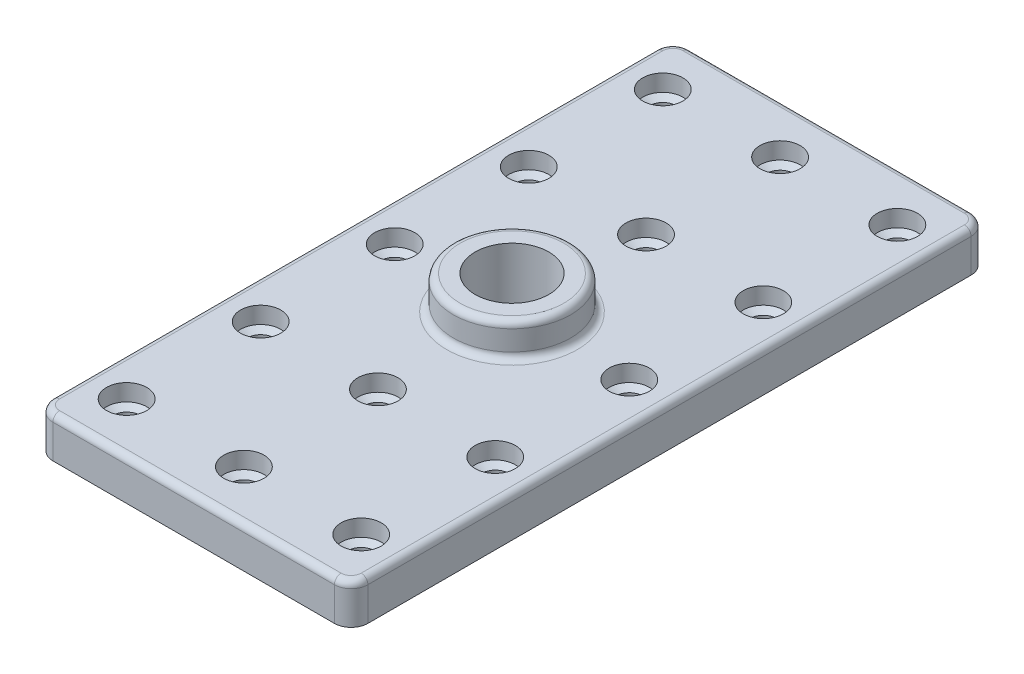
ISO-10303-21;
HEADER;
FILE_DESCRIPTION(('STEP AP214'),'2;1');
FILE_NAME('part.step','',(''),(''),'','','');
FILE_SCHEMA(('AUTOMOTIVE_DESIGN { 1 0 10303 214 1 1 1 1 }'));
ENDSEC;
DATA;
#1=APPLICATION_CONTEXT('core data for automotive mechanical design processes');
#2=APPLICATION_PROTOCOL_DEFINITION('international standard','automotive_design',2000,#1);
#3=PRODUCT_CONTEXT('',#1,'mechanical');
#4=PRODUCT('Part','Part','',(#3));
#5=PRODUCT_RELATED_PRODUCT_CATEGORY('part','',(#4));
#6=PRODUCT_DEFINITION_FORMATION('','',#4);
#7=PRODUCT_DEFINITION_CONTEXT('part definition',#1,'design');
#8=PRODUCT_DEFINITION('design','',#6,#7);
#9=PRODUCT_DEFINITION_SHAPE('','',#8);
#10=(LENGTH_UNIT() NAMED_UNIT(*) SI_UNIT(.MILLI.,.METRE.));
#11=(NAMED_UNIT(*) PLANE_ANGLE_UNIT() SI_UNIT($,.RADIAN.));
#12=(NAMED_UNIT(*) SI_UNIT($,.STERADIAN.) SOLID_ANGLE_UNIT());
#13=UNCERTAINTY_MEASURE_WITH_UNIT(LENGTH_MEASURE(1.E-05),#10,'distance_accuracy_value','');
#14=(GEOMETRIC_REPRESENTATION_CONTEXT(3) GLOBAL_UNCERTAINTY_ASSIGNED_CONTEXT((#13)) GLOBAL_UNIT_ASSIGNED_CONTEXT((#10,
#11,#12)) REPRESENTATION_CONTEXT('',''));
#15=CARTESIAN_POINT('',(0.,0.,0.));
#16=DIRECTION('',(0.,0.,1.));
#17=DIRECTION('',(1.,0.,0.));
#18=AXIS2_PLACEMENT_3D('',#15,#16,#17);
#19=CARTESIAN_POINT('',(-47.,0.,-95.));
#20=DIRECTION('',(0.,-1.,0.));
#21=DIRECTION('',(0.,0.,-1.));
#22=AXIS2_PLACEMENT_3D('',#19,#20,#21);
#23=PLANE('',#22);
#24=CARTESIAN_POINT('',(0.,0.,-80.));
#25=DIRECTION('',(0.,1.,0.));
#26=DIRECTION('',(0.,0.,1.));
#27=AXIS2_PLACEMENT_3D('',#24,#25,#26);
#28=CIRCLE('',#27,4.);
#29=CARTESIAN_POINT('',(0.,0.,-76.));
#30=VERTEX_POINT('',#29);
#31=EDGE_CURVE('E479',#30,#30,#28,.T.);
#32=ORIENTED_EDGE('',*,*,#31,.T.);
#33=EDGE_LOOP('',(#32));
#34=FACE_BOUND('',#33,.T.);
#35=CARTESIAN_POINT('',(35.,0.,-40.));
#36=DIRECTION('',(0.,1.,0.));
#37=DIRECTION('',(0.,0.,1.));
#38=AXIS2_PLACEMENT_3D('',#35,#36,#37);
#39=CIRCLE('',#38,4.);
#40=CARTESIAN_POINT('',(35.,0.,-36.));
#41=VERTEX_POINT('',#40);
#42=EDGE_CURVE('E455',#41,#41,#39,.T.);
#43=ORIENTED_EDGE('',*,*,#42,.T.);
#44=EDGE_LOOP('',(#43));
#45=FACE_BOUND('',#44,.T.);
#46=CARTESIAN_POINT('',(-35.,0.,-40.));
#47=DIRECTION('',(0.,1.,0.));
#48=DIRECTION('',(0.,0.,1.));
#49=AXIS2_PLACEMENT_3D('',#46,#47,#48);
#50=CIRCLE('',#49,4.);
#51=CARTESIAN_POINT('',(-35.,0.,-36.));
#52=VERTEX_POINT('',#51);
#53=EDGE_CURVE('E431',#52,#52,#50,.T.);
#54=ORIENTED_EDGE('',*,*,#53,.T.);
#55=EDGE_LOOP('',(#54));
#56=FACE_BOUND('',#55,.T.);
#57=CARTESIAN_POINT('',(-35.,0.,0.));
#58=DIRECTION('',(0.,1.,0.));
#59=DIRECTION('',(0.,0.,1.));
#60=AXIS2_PLACEMENT_3D('',#57,#58,#59);
#61=CIRCLE('',#60,4.);
#62=CARTESIAN_POINT('',(-35.,0.,3.99999999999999));
#63=VERTEX_POINT('',#62);
#64=EDGE_CURVE('E407',#63,#63,#61,.T.);
#65=ORIENTED_EDGE('',*,*,#64,.T.);
#66=EDGE_LOOP('',(#65));
#67=FACE_BOUND('',#66,.T.);
#68=CARTESIAN_POINT('',(0.,0.,40.));
#69=DIRECTION('',(0.,1.,0.));
#70=DIRECTION('',(0.,0.,1.));
#71=AXIS2_PLACEMENT_3D('',#68,#69,#70);
#72=CIRCLE('',#71,4.);
#73=CARTESIAN_POINT('',(0.,0.,44.));
#74=VERTEX_POINT('',#73);
#75=EDGE_CURVE('E383',#74,#74,#72,.T.);
#76=ORIENTED_EDGE('',*,*,#75,.T.);
#77=EDGE_LOOP('',(#76));
#78=FACE_BOUND('',#77,.T.);
#79=CARTESIAN_POINT('',(35.,0.,80.));
#80=DIRECTION('',(0.,1.,0.));
#81=DIRECTION('',(0.,0.,1.));
#82=AXIS2_PLACEMENT_3D('',#79,#80,#81);
#83=CIRCLE('',#82,4.);
#84=CARTESIAN_POINT('',(35.,0.,84.));
#85=VERTEX_POINT('',#84);
#86=EDGE_CURVE('E359',#85,#85,#83,.T.);
#87=ORIENTED_EDGE('',*,*,#86,.T.);
#88=EDGE_LOOP('',(#87));
#89=FACE_BOUND('',#88,.T.);
#90=CARTESIAN_POINT('',(-35.,0.,80.));
#91=DIRECTION('',(0.,1.,0.));
#92=DIRECTION('',(0.,0.,1.));
#93=AXIS2_PLACEMENT_3D('',#90,#91,#92);
#94=CIRCLE('',#93,4.);
#95=CARTESIAN_POINT('',(-35.,0.,84.));
#96=VERTEX_POINT('',#95);
#97=EDGE_CURVE('E287',#96,#96,#94,.T.);
#98=ORIENTED_EDGE('',*,*,#97,.T.);
#99=EDGE_LOOP('',(#98));
#100=FACE_BOUND('',#99,.T.);
#101=CARTESIAN_POINT('',(0.,0.,0.));
#102=DIRECTION('',(0.,1.,0.));
#103=DIRECTION('',(0.,0.,1.));
#104=AXIS2_PLACEMENT_3D('',#101,#102,#103);
#105=CIRCLE('',#104,11.);
#106=CARTESIAN_POINT('',(0.,0.,11.));
#107=VERTEX_POINT('',#106);
#108=EDGE_CURVE('E302',#107,#107,#105,.T.);
#109=ORIENTED_EDGE('',*,*,#108,.T.);
#110=EDGE_LOOP('',(#109));
#111=FACE_BOUND('',#110,.T.);
#112=DIRECTION('',(0.,0.,-1.));
#113=VECTOR('',#112,1.);
#114=CARTESIAN_POINT('',(47.,0.,95.));
#115=LINE('',#114,#113);
#116=CARTESIAN_POINT('',(47.,0.,90.));
#117=VERTEX_POINT('',#116);
#118=CARTESIAN_POINT('',(47.,0.,-90.));
#119=VERTEX_POINT('',#118);
#120=EDGE_CURVE('E125',#117,#119,#115,.T.);
#121=ORIENTED_EDGE('',*,*,#120,.F.);
#122=CARTESIAN_POINT('',(42.,0.,90.));
#123=DIRECTION('',(0.,-1.,0.));
#124=DIRECTION('',(0.,0.,-1.));
#125=AXIS2_PLACEMENT_3D('',#122,#123,#124);
#126=CIRCLE('',#125,5.);
#127=CARTESIAN_POINT('',(42.,0.,95.));
#128=VERTEX_POINT('',#127);
#129=EDGE_CURVE('E134',#117,#128,#126,.T.);
#130=ORIENTED_EDGE('',*,*,#129,.T.);
#131=DIRECTION('',(1.,0.,0.));
#132=VECTOR('',#131,1.);
#133=CARTESIAN_POINT('',(-47.,0.,95.));
#134=LINE('',#133,#132);
#135=CARTESIAN_POINT('',(-42.,0.,95.));
#136=VERTEX_POINT('',#135);
#137=EDGE_CURVE('E148',#136,#128,#134,.T.);
#138=ORIENTED_EDGE('',*,*,#137,.F.);
#139=CARTESIAN_POINT('',(-42.,0.,90.));
#140=DIRECTION('',(0.,-1.,0.));
#141=DIRECTION('',(0.,0.,-1.));
#142=AXIS2_PLACEMENT_3D('',#139,#140,#141);
#143=CIRCLE('',#142,5.);
#144=CARTESIAN_POINT('',(-47.,0.,90.));
#145=VERTEX_POINT('',#144);
#146=EDGE_CURVE('E142',#136,#145,#143,.T.);
#147=ORIENTED_EDGE('',*,*,#146,.T.);
#148=DIRECTION('',(0.,0.,1.));
#149=VECTOR('',#148,1.);
#150=CARTESIAN_POINT('',(-47.,0.,95.));
#151=LINE('',#150,#149);
#152=CARTESIAN_POINT('',(-47.,0.,-90.));
#153=VERTEX_POINT('',#152);
#154=EDGE_CURVE('E152',#153,#145,#151,.T.);
#155=ORIENTED_EDGE('',*,*,#154,.F.);
#156=CARTESIAN_POINT('',(-42.,0.,-90.));
#157=DIRECTION('',(0.,-1.,0.));
#158=DIRECTION('',(0.,0.,-1.));
#159=AXIS2_PLACEMENT_3D('',#156,#157,#158);
#160=CIRCLE('',#159,5.);
#161=CARTESIAN_POINT('',(-42.,0.,-95.));
#162=VERTEX_POINT('',#161);
#163=EDGE_CURVE('E158',#153,#162,#160,.T.);
#164=ORIENTED_EDGE('',*,*,#163,.T.);
#165=DIRECTION('',(-1.,0.,0.));
#166=VECTOR('',#165,1.);
#167=CARTESIAN_POINT('',(-47.,0.,-95.));
#168=LINE('',#167,#166);
#169=CARTESIAN_POINT('',(42.,0.,-95.));
#170=VERTEX_POINT('',#169);
#171=EDGE_CURVE('E147',#170,#162,#168,.T.);
#172=ORIENTED_EDGE('',*,*,#171,.F.);
#173=CARTESIAN_POINT('',(42.,0.,-90.));
#174=DIRECTION('',(0.,-1.,0.));
#175=DIRECTION('',(0.,0.,-1.));
#176=AXIS2_PLACEMENT_3D('',#173,#174,#175);
#177=CIRCLE('',#176,5.);
#178=EDGE_CURVE('E130',#170,#119,#177,.T.);
#179=ORIENTED_EDGE('',*,*,#178,.T.);
#180=EDGE_LOOP('',(#121,#130,#138,#147,#155,#164,#172,#179));
#181=FACE_BOUND('',#180,.T.);
#182=CARTESIAN_POINT('',(0.,0.,80.));
#183=DIRECTION('',(0.,1.,0.));
#184=DIRECTION('',(0.,0.,1.));
#185=AXIS2_PLACEMENT_3D('',#182,#183,#184);
#186=CIRCLE('',#185,4.);
#187=CARTESIAN_POINT('',(0.,0.,84.));
#188=VERTEX_POINT('',#187);
#189=EDGE_CURVE('E347',#188,#188,#186,.T.);
#190=ORIENTED_EDGE('',*,*,#189,.T.);
#191=EDGE_LOOP('',(#190));
#192=FACE_BOUND('',#191,.T.);
#193=CARTESIAN_POINT('',(-35.,0.,40.));
#194=DIRECTION('',(0.,1.,0.));
#195=DIRECTION('',(0.,0.,1.));
#196=AXIS2_PLACEMENT_3D('',#193,#194,#195);
#197=CIRCLE('',#196,4.);
#198=CARTESIAN_POINT('',(-35.,0.,44.));
#199=VERTEX_POINT('',#198);
#200=EDGE_CURVE('E371',#199,#199,#197,.T.);
#201=ORIENTED_EDGE('',*,*,#200,.T.);
#202=EDGE_LOOP('',(#201));
#203=FACE_BOUND('',#202,.T.);
#204=CARTESIAN_POINT('',(35.,0.,40.));
#205=DIRECTION('',(0.,1.,0.));
#206=DIRECTION('',(0.,0.,1.));
#207=AXIS2_PLACEMENT_3D('',#204,#205,#206);
#208=CIRCLE('',#207,4.);
#209=CARTESIAN_POINT('',(35.,0.,44.));
#210=VERTEX_POINT('',#209);
#211=EDGE_CURVE('E395',#210,#210,#208,.T.);
#212=ORIENTED_EDGE('',*,*,#211,.T.);
#213=EDGE_LOOP('',(#212));
#214=FACE_BOUND('',#213,.T.);
#215=CARTESIAN_POINT('',(35.,0.,0.));
#216=DIRECTION('',(0.,1.,0.));
#217=DIRECTION('',(0.,0.,1.));
#218=AXIS2_PLACEMENT_3D('',#215,#216,#217);
#219=CIRCLE('',#218,4.);
#220=CARTESIAN_POINT('',(35.,0.,3.99999999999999));
#221=VERTEX_POINT('',#220);
#222=EDGE_CURVE('E419',#221,#221,#219,.T.);
#223=ORIENTED_EDGE('',*,*,#222,.T.);
#224=EDGE_LOOP('',(#223));
#225=FACE_BOUND('',#224,.T.);
#226=CARTESIAN_POINT('',(0.,0.,-40.));
#227=DIRECTION('',(0.,1.,0.));
#228=DIRECTION('',(0.,0.,1.));
#229=AXIS2_PLACEMENT_3D('',#226,#227,#228);
#230=CIRCLE('',#229,4.);
#231=CARTESIAN_POINT('',(0.,0.,-36.));
#232=VERTEX_POINT('',#231);
#233=EDGE_CURVE('E443',#232,#232,#230,.T.);
#234=ORIENTED_EDGE('',*,*,#233,.T.);
#235=EDGE_LOOP('',(#234));
#236=FACE_BOUND('',#235,.T.);
#237=CARTESIAN_POINT('',(-35.,0.,-80.));
#238=DIRECTION('',(0.,1.,0.));
#239=DIRECTION('',(0.,0.,1.));
#240=AXIS2_PLACEMENT_3D('',#237,#238,#239);
#241=CIRCLE('',#240,4.);
#242=CARTESIAN_POINT('',(-35.,0.,-76.));
#243=VERTEX_POINT('',#242);
#244=EDGE_CURVE('E467',#243,#243,#241,.T.);
#245=ORIENTED_EDGE('',*,*,#244,.T.);
#246=EDGE_LOOP('',(#245));
#247=FACE_BOUND('',#246,.T.);
#248=CARTESIAN_POINT('',(35.,0.,-80.));
#249=DIRECTION('',(0.,1.,0.));
#250=DIRECTION('',(0.,0.,1.));
#251=AXIS2_PLACEMENT_3D('',#248,#249,#250);
#252=CIRCLE('',#251,4.);
#253=CARTESIAN_POINT('',(35.,0.,-76.));
#254=VERTEX_POINT('',#253);
#255=EDGE_CURVE('E490',#254,#254,#252,.T.);
#256=ORIENTED_EDGE('',*,*,#255,.T.);
#257=EDGE_LOOP('',(#256));
#258=FACE_BOUND('',#257,.T.);
#259=ADVANCED_FACE('F28',(#34,#45,#56,#67,#78,#89,#100,#111,#181,#192,#203,#214,#225,#236,#247,
#258),#23,.T.);
#260=CARTESIAN_POINT('',(-47.,12.,-95.));
#261=DIRECTION('',(0.,-1.,0.));
#262=DIRECTION('',(0.,0.,-1.));
#263=AXIS2_PLACEMENT_3D('',#260,#261,#262);
#264=PLANE('',#263);
#265=CARTESIAN_POINT('',(35.,12.,-80.));
#266=DIRECTION('',(0.,1.,0.));
#267=DIRECTION('',(0.,0.,1.));
#268=AXIS2_PLACEMENT_3D('',#265,#266,#267);
#269=CIRCLE('',#268,6.);
#270=CARTESIAN_POINT('',(35.,12.,-74.));
#271=VERTEX_POINT('',#270);
#272=EDGE_CURVE('E481',#271,#271,#269,.T.);
#273=ORIENTED_EDGE('',*,*,#272,.F.);
#274=EDGE_LOOP('',(#273));
#275=FACE_BOUND('',#274,.T.);
#276=CARTESIAN_POINT('',(0.,12.,-80.));
#277=DIRECTION('',(0.,1.,0.));
#278=DIRECTION('',(0.,0.,1.));
#279=AXIS2_PLACEMENT_3D('',#276,#277,#278);
#280=CIRCLE('',#279,6.);
#281=CARTESIAN_POINT('',(0.,12.,-74.));
#282=VERTEX_POINT('',#281);
#283=EDGE_CURVE('E470',#282,#282,#280,.T.);
#284=ORIENTED_EDGE('',*,*,#283,.F.);
#285=EDGE_LOOP('',(#284));
#286=FACE_BOUND('',#285,.T.);
#287=CARTESIAN_POINT('',(-35.,12.,-80.));
#288=DIRECTION('',(0.,1.,0.));
#289=DIRECTION('',(0.,0.,1.));
#290=AXIS2_PLACEMENT_3D('',#287,#288,#289);
#291=CIRCLE('',#290,6.);
#292=CARTESIAN_POINT('',(-35.,12.,-74.));
#293=VERTEX_POINT('',#292);
#294=EDGE_CURVE('E458',#293,#293,#291,.T.);
#295=ORIENTED_EDGE('',*,*,#294,.F.);
#296=EDGE_LOOP('',(#295));
#297=FACE_BOUND('',#296,.T.);
#298=CARTESIAN_POINT('',(35.,12.,-40.));
#299=DIRECTION('',(0.,1.,0.));
#300=DIRECTION('',(0.,0.,1.));
#301=AXIS2_PLACEMENT_3D('',#298,#299,#300);
#302=CIRCLE('',#301,6.);
#303=CARTESIAN_POINT('',(35.,12.,-34.));
#304=VERTEX_POINT('',#303);
#305=EDGE_CURVE('E446',#304,#304,#302,.T.);
#306=ORIENTED_EDGE('',*,*,#305,.F.);
#307=EDGE_LOOP('',(#306));
#308=FACE_BOUND('',#307,.T.);
#309=CARTESIAN_POINT('',(0.,12.,-40.));
#310=DIRECTION('',(0.,1.,0.));
#311=DIRECTION('',(0.,0.,1.));
#312=AXIS2_PLACEMENT_3D('',#309,#310,#311);
#313=CIRCLE('',#312,6.);
#314=CARTESIAN_POINT('',(0.,12.,-34.));
#315=VERTEX_POINT('',#314);
#316=EDGE_CURVE('E434',#315,#315,#313,.T.);
#317=ORIENTED_EDGE('',*,*,#316,.F.);
#318=EDGE_LOOP('',(#317));
#319=FACE_BOUND('',#318,.T.);
#320=CARTESIAN_POINT('',(-35.,12.,-40.));
#321=DIRECTION('',(0.,1.,0.));
#322=DIRECTION('',(0.,0.,1.));
#323=AXIS2_PLACEMENT_3D('',#320,#321,#322);
#324=CIRCLE('',#323,6.);
#325=CARTESIAN_POINT('',(-35.,12.,-34.));
#326=VERTEX_POINT('',#325);
#327=EDGE_CURVE('E422',#326,#326,#324,.T.);
#328=ORIENTED_EDGE('',*,*,#327,.F.);
#329=EDGE_LOOP('',(#328));
#330=FACE_BOUND('',#329,.T.);
#331=CARTESIAN_POINT('',(35.,12.,0.));
#332=DIRECTION('',(0.,1.,0.));
#333=DIRECTION('',(0.,0.,1.));
#334=AXIS2_PLACEMENT_3D('',#331,#332,#333);
#335=CIRCLE('',#334,6.);
#336=CARTESIAN_POINT('',(35.,12.,5.99999999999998));
#337=VERTEX_POINT('',#336);
#338=EDGE_CURVE('E410',#337,#337,#335,.T.);
#339=ORIENTED_EDGE('',*,*,#338,.F.);
#340=EDGE_LOOP('',(#339));
#341=FACE_BOUND('',#340,.T.);
#342=CARTESIAN_POINT('',(-35.,12.,0.));
#343=DIRECTION('',(0.,1.,0.));
#344=DIRECTION('',(0.,0.,1.));
#345=AXIS2_PLACEMENT_3D('',#342,#343,#344);
#346=CIRCLE('',#345,6.);
#347=CARTESIAN_POINT('',(-35.,12.,5.99999999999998));
#348=VERTEX_POINT('',#347);
#349=EDGE_CURVE('E398',#348,#348,#346,.T.);
#350=ORIENTED_EDGE('',*,*,#349,.F.);
#351=EDGE_LOOP('',(#350));
#352=FACE_BOUND('',#351,.T.);
#353=CARTESIAN_POINT('',(35.,12.,40.));
#354=DIRECTION('',(0.,1.,0.));
#355=DIRECTION('',(0.,0.,1.));
#356=AXIS2_PLACEMENT_3D('',#353,#354,#355);
#357=CIRCLE('',#356,6.);
#358=CARTESIAN_POINT('',(35.,12.,46.));
#359=VERTEX_POINT('',#358);
#360=EDGE_CURVE('E386',#359,#359,#357,.T.);
#361=ORIENTED_EDGE('',*,*,#360,.F.);
#362=EDGE_LOOP('',(#361));
#363=FACE_BOUND('',#362,.T.);
#364=CARTESIAN_POINT('',(0.,12.,40.));
#365=DIRECTION('',(0.,1.,0.));
#366=DIRECTION('',(0.,0.,1.));
#367=AXIS2_PLACEMENT_3D('',#364,#365,#366);
#368=CIRCLE('',#367,6.);
#369=CARTESIAN_POINT('',(0.,12.,46.));
#370=VERTEX_POINT('',#369);
#371=EDGE_CURVE('E374',#370,#370,#368,.T.);
#372=ORIENTED_EDGE('',*,*,#371,.F.);
#373=EDGE_LOOP('',(#372));
#374=FACE_BOUND('',#373,.T.);
#375=CARTESIAN_POINT('',(-35.,12.,40.));
#376=DIRECTION('',(0.,1.,0.));
#377=DIRECTION('',(0.,0.,1.));
#378=AXIS2_PLACEMENT_3D('',#375,#376,#377);
#379=CIRCLE('',#378,6.);
#380=CARTESIAN_POINT('',(-35.,12.,46.));
#381=VERTEX_POINT('',#380);
#382=EDGE_CURVE('E362',#381,#381,#379,.T.);
#383=ORIENTED_EDGE('',*,*,#382,.F.);
#384=EDGE_LOOP('',(#383));
#385=FACE_BOUND('',#384,.T.);
#386=CARTESIAN_POINT('',(35.,12.,80.));
#387=DIRECTION('',(0.,1.,0.));
#388=DIRECTION('',(0.,0.,1.));
#389=AXIS2_PLACEMENT_3D('',#386,#387,#388);
#390=CIRCLE('',#389,6.);
#391=CARTESIAN_POINT('',(35.,12.,86.));
#392=VERTEX_POINT('',#391);
#393=EDGE_CURVE('E350',#392,#392,#390,.T.);
#394=ORIENTED_EDGE('',*,*,#393,.F.);
#395=EDGE_LOOP('',(#394));
#396=FACE_BOUND('',#395,.T.);
#397=CARTESIAN_POINT('',(0.,12.,80.));
#398=DIRECTION('',(0.,1.,0.));
#399=DIRECTION('',(0.,0.,1.));
#400=AXIS2_PLACEMENT_3D('',#397,#398,#399);
#401=CIRCLE('',#400,6.);
#402=CARTESIAN_POINT('',(0.,12.,86.));
#403=VERTEX_POINT('',#402);
#404=EDGE_CURVE('E336',#403,#403,#401,.T.);
#405=ORIENTED_EDGE('',*,*,#404,.F.);
#406=EDGE_LOOP('',(#405));
#407=FACE_BOUND('',#406,.T.);
#408=CARTESIAN_POINT('',(42.,12.,90.));
#409=DIRECTION('',(0.,-1.,0.));
#410=DIRECTION('',(0.,0.,-1.));
#411=AXIS2_PLACEMENT_3D('',#408,#409,#410);
#412=CIRCLE('',#411,3.);
#413=CARTESIAN_POINT('',(42.,12.,93.));
#414=VERTEX_POINT('',#413);
#415=CARTESIAN_POINT('',(45.,12.,90.));
#416=VERTEX_POINT('',#415);
#417=EDGE_CURVE('E185',#414,#416,#412,.F.);
#418=ORIENTED_EDGE('',*,*,#417,.T.);
#419=DIRECTION('',(0.,0.,-1.));
#420=VECTOR('',#419,1.);
#421=CARTESIAN_POINT('',(45.,12.,-95.));
#422=LINE('',#421,#420);
#423=CARTESIAN_POINT('',(45.,12.,-90.));
#424=VERTEX_POINT('',#423);
#425=EDGE_CURVE('E189',#416,#424,#422,.T.);
#426=ORIENTED_EDGE('',*,*,#425,.T.);
#427=CARTESIAN_POINT('',(42.,12.,-90.));
#428=DIRECTION('',(0.,-1.,0.));
#429=DIRECTION('',(0.,0.,-1.));
#430=AXIS2_PLACEMENT_3D('',#427,#428,#429);
#431=CIRCLE('',#430,3.);
#432=CARTESIAN_POINT('',(42.,12.,-93.));
#433=VERTEX_POINT('',#432);
#434=EDGE_CURVE('E187',#424,#433,#431,.F.);
#435=ORIENTED_EDGE('',*,*,#434,.T.);
#436=DIRECTION('',(-1.,0.,0.));
#437=VECTOR('',#436,1.);
#438=CARTESIAN_POINT('',(-47.,12.,-93.));
#439=LINE('',#438,#437);
#440=CARTESIAN_POINT('',(-42.,12.,-93.));
#441=VERTEX_POINT('',#440);
#442=EDGE_CURVE('E183',#433,#441,#439,.T.);
#443=ORIENTED_EDGE('',*,*,#442,.T.);
#444=CARTESIAN_POINT('',(-42.,12.,-90.));
#445=DIRECTION('',(0.,-1.,0.));
#446=DIRECTION('',(0.,0.,-1.));
#447=AXIS2_PLACEMENT_3D('',#444,#445,#446);
#448=CIRCLE('',#447,3.);
#449=CARTESIAN_POINT('',(-45.,12.,-90.));
#450=VERTEX_POINT('',#449);
#451=EDGE_CURVE('E179',#441,#450,#448,.F.);
#452=ORIENTED_EDGE('',*,*,#451,.T.);
#453=DIRECTION('',(0.,0.,1.));
#454=VECTOR('',#453,1.);
#455=CARTESIAN_POINT('',(-45.,12.,-95.));
#456=LINE('',#455,#454);
#457=CARTESIAN_POINT('',(-45.,12.,90.));
#458=VERTEX_POINT('',#457);
#459=EDGE_CURVE('E175',#450,#458,#456,.T.);
#460=ORIENTED_EDGE('',*,*,#459,.T.);
#461=CARTESIAN_POINT('',(-42.,12.,90.));
#462=DIRECTION('',(0.,-1.,0.));
#463=DIRECTION('',(0.,0.,-1.));
#464=AXIS2_PLACEMENT_3D('',#461,#462,#463);
#465=CIRCLE('',#464,3.);
#466=CARTESIAN_POINT('',(-42.,12.,93.));
#467=VERTEX_POINT('',#466);
#468=EDGE_CURVE('E177',#458,#467,#465,.F.);
#469=ORIENTED_EDGE('',*,*,#468,.T.);
#470=DIRECTION('',(1.,0.,0.));
#471=VECTOR('',#470,1.);
#472=CARTESIAN_POINT('',(-47.,12.,93.));
#473=LINE('',#472,#471);
#474=EDGE_CURVE('E181',#467,#414,#473,.T.);
#475=ORIENTED_EDGE('',*,*,#474,.T.);
#476=EDGE_LOOP('',(#418,#426,#435,#443,#452,#460,#469,#475));
#477=FACE_BOUND('',#476,.T.);
#478=CARTESIAN_POINT('',(0.,12.,0.));
#479=DIRECTION('',(0.,-1.,0.));
#480=DIRECTION('',(0.,0.,-1.));
#481=AXIS2_PLACEMENT_3D('',#478,#479,#480);
#482=CIRCLE('',#481,19.5);
#483=CARTESIAN_POINT('',(0.,12.,-19.5));
#484=VERTEX_POINT('',#483);
#485=EDGE_CURVE('E172',#484,#484,#482,.T.);
#486=ORIENTED_EDGE('',*,*,#485,.T.);
#487=EDGE_LOOP('',(#486));
#488=FACE_BOUND('',#487,.T.);
#489=CARTESIAN_POINT('',(-35.,12.,80.));
#490=DIRECTION('',(0.,1.,0.));
#491=DIRECTION('',(0.,0.,1.));
#492=AXIS2_PLACEMENT_3D('',#489,#490,#491);
#493=CIRCLE('',#492,6.);
#494=CARTESIAN_POINT('',(-35.,12.,86.));
#495=VERTEX_POINT('',#494);
#496=EDGE_CURVE('E296',#495,#495,#493,.T.);
#497=ORIENTED_EDGE('',*,*,#496,.F.);
#498=EDGE_LOOP('',(#497));
#499=FACE_BOUND('',#498,.T.);
#500=ADVANCED_FACE('F231',(#275,#286,#297,#308,#319,#330,#341,#352,#363,#374,#385,#396,#407,
#477,#488,#499),#264,.F.);
#501=CARTESIAN_POINT('',(-47.,12.,95.));
#502=DIRECTION('',(1.,0.,0.));
#503=DIRECTION('',(0.,0.,-1.));
#504=AXIS2_PLACEMENT_3D('',#501,#502,#503);
#505=PLANE('',#504);
#506=DIRECTION('',(0.,-1.,0.));
#507=VECTOR('',#506,1.);
#508=CARTESIAN_POINT('',(-47.,12.,90.));
#509=LINE('',#508,#507);
#510=CARTESIAN_POINT('',(-47.,10.,90.));
#511=VERTEX_POINT('',#510);
#512=EDGE_CURVE('E165',#145,#511,#509,.F.);
#513=ORIENTED_EDGE('',*,*,#512,.T.);
#514=DIRECTION('',(0.,0.,1.));
#515=VECTOR('',#514,1.);
#516=CARTESIAN_POINT('',(-47.,10.,95.));
#517=LINE('',#516,#515);
#518=CARTESIAN_POINT('',(-47.,10.,-90.));
#519=VERTEX_POINT('',#518);
#520=EDGE_CURVE('E50',#511,#519,#517,.F.);
#521=ORIENTED_EDGE('',*,*,#520,.T.);
#522=DIRECTION('',(0.,-1.,0.));
#523=VECTOR('',#522,1.);
#524=CARTESIAN_POINT('',(-47.,12.,-90.));
#525=LINE('',#524,#523);
#526=EDGE_CURVE('E163',#519,#153,#525,.T.);
#527=ORIENTED_EDGE('',*,*,#526,.T.);
#528=ORIENTED_EDGE('',*,*,#154,.T.);
#529=EDGE_LOOP('',(#513,#521,#527,#528));
#530=FACE_BOUND('',#529,.T.);
#531=ADVANCED_FACE('F30',(#530),#505,.F.);
#532=CARTESIAN_POINT('',(-47.,12.,95.));
#533=DIRECTION('',(0.,0.,-1.));
#534=DIRECTION('',(-1.,0.,0.));
#535=AXIS2_PLACEMENT_3D('',#532,#533,#534);
#536=PLANE('',#535);
#537=DIRECTION('',(0.,-1.,0.));
#538=VECTOR('',#537,1.);
#539=CARTESIAN_POINT('',(42.,12.,95.));
#540=LINE('',#539,#538);
#541=CARTESIAN_POINT('',(42.,10.,95.));
#542=VERTEX_POINT('',#541);
#543=EDGE_CURVE('E137',#128,#542,#540,.F.);
#544=ORIENTED_EDGE('',*,*,#543,.T.);
#545=DIRECTION('',(1.,0.,0.));
#546=VECTOR('',#545,1.);
#547=CARTESIAN_POINT('',(-47.,10.,95.));
#548=LINE('',#547,#546);
#549=CARTESIAN_POINT('',(-42.,10.,95.));
#550=VERTEX_POINT('',#549);
#551=EDGE_CURVE('E199',#542,#550,#548,.F.);
#552=ORIENTED_EDGE('',*,*,#551,.T.);
#553=DIRECTION('',(0.,-1.,0.));
#554=VECTOR('',#553,1.);
#555=CARTESIAN_POINT('',(-42.,12.,95.));
#556=LINE('',#555,#554);
#557=EDGE_CURVE('E141',#550,#136,#556,.T.);
#558=ORIENTED_EDGE('',*,*,#557,.T.);
#559=ORIENTED_EDGE('',*,*,#137,.T.);
#560=EDGE_LOOP('',(#544,#552,#558,#559));
#561=FACE_BOUND('',#560,.T.);
#562=ADVANCED_FACE('F249',(#561),#536,.F.);
#563=CARTESIAN_POINT('',(47.,12.,95.));
#564=DIRECTION('',(-1.,0.,0.));
#565=DIRECTION('',(0.,0.,1.));
#566=AXIS2_PLACEMENT_3D('',#563,#564,#565);
#567=PLANE('',#566);
#568=DIRECTION('',(0.,-1.,0.));
#569=VECTOR('',#568,1.);
#570=CARTESIAN_POINT('',(47.,12.,-90.));
#571=LINE('',#570,#569);
#572=CARTESIAN_POINT('',(47.,10.,-90.));
#573=VERTEX_POINT('',#572);
#574=EDGE_CURVE('E131',#119,#573,#571,.F.);
#575=ORIENTED_EDGE('',*,*,#574,.T.);
#576=DIRECTION('',(0.,0.,-1.));
#577=VECTOR('',#576,1.);
#578=CARTESIAN_POINT('',(47.,10.,95.));
#579=LINE('',#578,#577);
#580=CARTESIAN_POINT('',(47.,10.,90.));
#581=VERTEX_POINT('',#580);
#582=EDGE_CURVE('E128',#573,#581,#579,.F.);
#583=ORIENTED_EDGE('',*,*,#582,.T.);
#584=DIRECTION('',(0.,-1.,0.));
#585=VECTOR('',#584,1.);
#586=CARTESIAN_POINT('',(47.,12.,90.));
#587=LINE('',#586,#585);
#588=EDGE_CURVE('E120',#581,#117,#587,.T.);
#589=ORIENTED_EDGE('',*,*,#588,.T.);
#590=ORIENTED_EDGE('',*,*,#120,.T.);
#591=EDGE_LOOP('',(#575,#583,#589,#590));
#592=FACE_BOUND('',#591,.T.);
#593=ADVANCED_FACE('F123',(#592),#567,.F.);
#594=CARTESIAN_POINT('',(-47.,12.,-95.));
#595=DIRECTION('',(0.,0.,1.));
#596=DIRECTION('',(1.,0.,0.));
#597=AXIS2_PLACEMENT_3D('',#594,#595,#596);
#598=PLANE('',#597);
#599=DIRECTION('',(0.,-1.,0.));
#600=VECTOR('',#599,1.);
#601=CARTESIAN_POINT('',(-42.,12.,-95.));
#602=LINE('',#601,#600);
#603=CARTESIAN_POINT('',(-42.,10.,-95.));
#604=VERTEX_POINT('',#603);
#605=EDGE_CURVE('E169',#162,#604,#602,.F.);
#606=ORIENTED_EDGE('',*,*,#605,.T.);
#607=DIRECTION('',(-1.,0.,0.));
#608=VECTOR('',#607,1.);
#609=CARTESIAN_POINT('',(-47.,10.,-95.));
#610=LINE('',#609,#608);
#611=CARTESIAN_POINT('',(42.,10.,-95.));
#612=VERTEX_POINT('',#611);
#613=EDGE_CURVE('E197',#604,#612,#610,.F.);
#614=ORIENTED_EDGE('',*,*,#613,.T.);
#615=DIRECTION('',(0.,-1.,0.));
#616=VECTOR('',#615,1.);
#617=CARTESIAN_POINT('',(42.,12.,-95.));
#618=LINE('',#617,#616);
#619=EDGE_CURVE('E167',#612,#170,#618,.T.);
#620=ORIENTED_EDGE('',*,*,#619,.T.);
#621=ORIENTED_EDGE('',*,*,#171,.T.);
#622=EDGE_LOOP('',(#606,#614,#620,#621));
#623=FACE_BOUND('',#622,.T.);
#624=ADVANCED_FACE('F244',(#623),#598,.F.);
#625=CARTESIAN_POINT('',(0.,22.,0.));
#626=DIRECTION('',(0.,-1.,0.));
#627=DIRECTION('',(0.,0.,-1.));
#628=AXIS2_PLACEMENT_3D('',#625,#626,#627);
#629=CYLINDRICAL_SURFACE('',#628,17.5);
#630=CARTESIAN_POINT('',(0.,14.,0.));
#631=DIRECTION('',(0.,-1.,0.));
#632=DIRECTION('',(0.,0.,-1.));
#633=AXIS2_PLACEMENT_3D('',#630,#631,#632);
#634=CIRCLE('',#633,17.5);
#635=CARTESIAN_POINT('',(0.,14.,-17.5));
#636=VERTEX_POINT('',#635);
#637=EDGE_CURVE('E36',#636,#636,#634,.F.);
#638=ORIENTED_EDGE('',*,*,#637,.T.);
#639=EDGE_LOOP('',(#638));
#640=FACE_BOUND('',#639,.T.);
#641=CARTESIAN_POINT('',(0.,20.,0.));
#642=DIRECTION('',(0.,1.,0.));
#643=DIRECTION('',(0.,0.,1.));
#644=AXIS2_PLACEMENT_3D('',#641,#642,#643);
#645=CIRCLE('',#644,17.5);
#646=CARTESIAN_POINT('',(0.,20.,17.5));
#647=VERTEX_POINT('',#646);
#648=EDGE_CURVE('E205',#647,#647,#645,.F.);
#649=ORIENTED_EDGE('',*,*,#648,.T.);
#650=EDGE_LOOP('',(#649));
#651=FACE_BOUND('',#650,.T.);
#652=ADVANCED_FACE('F210',(#640,#651),#629,.T.);
#653=CARTESIAN_POINT('',(0.,22.,0.));
#654=DIRECTION('',(0.,1.,0.));
#655=DIRECTION('',(0.,0.,1.));
#656=AXIS2_PLACEMENT_3D('',#653,#654,#655);
#657=PLANE('',#656);
#658=CARTESIAN_POINT('',(0.,22.,0.));
#659=DIRECTION('',(0.,1.,0.));
#660=DIRECTION('',(0.,0.,1.));
#661=AXIS2_PLACEMENT_3D('',#658,#659,#660);
#662=CIRCLE('',#661,15.5);
#663=CARTESIAN_POINT('',(0.,22.,15.5));
#664=VERTEX_POINT('',#663);
#665=EDGE_CURVE('E11',#664,#664,#662,.T.);
#666=ORIENTED_EDGE('',*,*,#665,.T.);
#667=EDGE_LOOP('',(#666));
#668=FACE_BOUND('',#667,.T.);
#669=CARTESIAN_POINT('',(0.,22.,0.));
#670=DIRECTION('',(0.,1.,0.));
#671=DIRECTION('',(0.,0.,1.));
#672=AXIS2_PLACEMENT_3D('',#669,#670,#671);
#673=CIRCLE('',#672,11.);
#674=CARTESIAN_POINT('',(0.,22.,11.));
#675=VERTEX_POINT('',#674);
#676=EDGE_CURVE('E299',#675,#675,#673,.T.);
#677=ORIENTED_EDGE('',*,*,#676,.F.);
#678=EDGE_LOOP('',(#677));
#679=FACE_BOUND('',#678,.T.);
#680=ADVANCED_FACE('F555',(#668,#679),#657,.T.);
#681=CARTESIAN_POINT('',(0.,0.,0.));
#682=DIRECTION('',(0.,1.,0.));
#683=DIRECTION('',(0.,0.,1.));
#684=AXIS2_PLACEMENT_3D('',#681,#682,#683);
#685=CYLINDRICAL_SURFACE('',#684,11.);
#686=ORIENTED_EDGE('',*,*,#108,.F.);
#687=EDGE_LOOP('',(#686));
#688=FACE_BOUND('',#687,.T.);
#689=ORIENTED_EDGE('',*,*,#676,.T.);
#690=EDGE_LOOP('',(#689));
#691=FACE_BOUND('',#690,.T.);
#692=ADVANCED_FACE('F545',(#688,#691),#685,.F.);
#693=CARTESIAN_POINT('',(-35.,12.,80.));
#694=DIRECTION('',(0.,1.,0.));
#695=DIRECTION('',(0.,0.,1.));
#696=AXIS2_PLACEMENT_3D('',#693,#694,#695);
#697=CYLINDRICAL_SURFACE('',#696,6.);
#698=CARTESIAN_POINT('',(-35.,7.,80.));
#699=DIRECTION('',(0.,1.,0.));
#700=DIRECTION('',(0.,0.,1.));
#701=AXIS2_PLACEMENT_3D('',#698,#699,#700);
#702=CIRCLE('',#701,6.);
#703=CARTESIAN_POINT('',(-35.,7.,86.));
#704=VERTEX_POINT('',#703);
#705=EDGE_CURVE('E293',#704,#704,#702,.T.);
#706=ORIENTED_EDGE('',*,*,#705,.F.);
#707=EDGE_LOOP('',(#706));
#708=FACE_BOUND('',#707,.T.);
#709=ORIENTED_EDGE('',*,*,#496,.T.);
#710=EDGE_LOOP('',(#709));
#711=FACE_BOUND('',#710,.T.);
#712=ADVANCED_FACE('F542',(#708,#711),#697,.F.);
#713=CARTESIAN_POINT('',(-35.,7.,80.));
#714=DIRECTION('',(0.,1.,0.));
#715=DIRECTION('',(0.,0.,1.));
#716=AXIS2_PLACEMENT_3D('',#713,#714,#715);
#717=CONICAL_SURFACE('',#716,6.,1.02974425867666);
#718=CARTESIAN_POINT('',(-35.,5.7982787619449,80.));
#719=DIRECTION('',(0.,1.,0.));
#720=DIRECTION('',(0.,0.,1.));
#721=AXIS2_PLACEMENT_3D('',#718,#719,#720);
#722=CIRCLE('',#721,4.00000000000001);
#723=CARTESIAN_POINT('',(-35.,5.7982787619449,84.));
#724=VERTEX_POINT('',#723);
#725=EDGE_CURVE('E290',#724,#724,#722,.T.);
#726=ORIENTED_EDGE('',*,*,#725,.F.);
#727=EDGE_LOOP('',(#726));
#728=FACE_BOUND('',#727,.T.);
#729=ORIENTED_EDGE('',*,*,#705,.T.);
#730=EDGE_LOOP('',(#729));
#731=FACE_BOUND('',#730,.T.);
#732=ADVANCED_FACE('F544',(#728,#731),#717,.F.);
#733=CARTESIAN_POINT('',(-35.,12.,80.));
#734=DIRECTION('',(0.,1.,0.));
#735=DIRECTION('',(0.,0.,1.));
#736=AXIS2_PLACEMENT_3D('',#733,#734,#735);
#737=CYLINDRICAL_SURFACE('',#736,4.00000000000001);
#738=ORIENTED_EDGE('',*,*,#97,.F.);
#739=EDGE_LOOP('',(#738));
#740=FACE_BOUND('',#739,.T.);
#741=ORIENTED_EDGE('',*,*,#725,.T.);
#742=EDGE_LOOP('',(#741));
#743=FACE_BOUND('',#742,.T.);
#744=ADVANCED_FACE('F552',(#740,#743),#737,.F.);
#745=CARTESIAN_POINT('',(42.,12.,90.));
#746=DIRECTION('',(0.,-1.,0.));
#747=DIRECTION('',(0.,0.,-1.));
#748=AXIS2_PLACEMENT_3D('',#745,#746,#747);
#749=CYLINDRICAL_SURFACE('',#748,5.);
#750=ORIENTED_EDGE('',*,*,#588,.F.);
#751=CARTESIAN_POINT('',(42.,10.,90.));
#752=DIRECTION('',(0.,-1.,0.));
#753=DIRECTION('',(0.,0.,-1.));
#754=AXIS2_PLACEMENT_3D('',#751,#752,#753);
#755=CIRCLE('',#754,5.);
#756=EDGE_CURVE('E195',#581,#542,#755,.T.);
#757=ORIENTED_EDGE('',*,*,#756,.T.);
#758=ORIENTED_EDGE('',*,*,#543,.F.);
#759=ORIENTED_EDGE('',*,*,#129,.F.);
#760=EDGE_LOOP('',(#750,#757,#758,#759));
#761=FACE_BOUND('',#760,.T.);
#762=ADVANCED_FACE('F135',(#761),#749,.T.);
#763=CARTESIAN_POINT('',(-42.,12.,90.));
#764=DIRECTION('',(0.,-1.,0.));
#765=DIRECTION('',(0.,0.,-1.));
#766=AXIS2_PLACEMENT_3D('',#763,#764,#765);
#767=CYLINDRICAL_SURFACE('',#766,5.);
#768=ORIENTED_EDGE('',*,*,#557,.F.);
#769=CARTESIAN_POINT('',(-42.,10.,90.));
#770=DIRECTION('',(0.,-1.,0.));
#771=DIRECTION('',(0.,0.,-1.));
#772=AXIS2_PLACEMENT_3D('',#769,#770,#771);
#773=CIRCLE('',#772,5.);
#774=EDGE_CURVE('E43',#550,#511,#773,.T.);
#775=ORIENTED_EDGE('',*,*,#774,.T.);
#776=ORIENTED_EDGE('',*,*,#512,.F.);
#777=ORIENTED_EDGE('',*,*,#146,.F.);
#778=EDGE_LOOP('',(#768,#775,#776,#777));
#779=FACE_BOUND('',#778,.T.);
#780=ADVANCED_FACE('F308',(#779),#767,.T.);
#781=CARTESIAN_POINT('',(-42.,12.,-90.));
#782=DIRECTION('',(0.,-1.,0.));
#783=DIRECTION('',(0.,0.,-1.));
#784=AXIS2_PLACEMENT_3D('',#781,#782,#783);
#785=CYLINDRICAL_SURFACE('',#784,5.);
#786=ORIENTED_EDGE('',*,*,#526,.F.);
#787=CARTESIAN_POINT('',(-42.,10.,-90.));
#788=DIRECTION('',(0.,-1.,0.));
#789=DIRECTION('',(0.,0.,-1.));
#790=AXIS2_PLACEMENT_3D('',#787,#788,#789);
#791=CIRCLE('',#790,5.);
#792=EDGE_CURVE('E201',#519,#604,#791,.T.);
#793=ORIENTED_EDGE('',*,*,#792,.T.);
#794=ORIENTED_EDGE('',*,*,#605,.F.);
#795=ORIENTED_EDGE('',*,*,#163,.F.);
#796=EDGE_LOOP('',(#786,#793,#794,#795));
#797=FACE_BOUND('',#796,.T.);
#798=ADVANCED_FACE('F325',(#797),#785,.T.);
#799=CARTESIAN_POINT('',(42.,12.,-90.));
#800=DIRECTION('',(0.,-1.,0.));
#801=DIRECTION('',(0.,0.,-1.));
#802=AXIS2_PLACEMENT_3D('',#799,#800,#801);
#803=CYLINDRICAL_SURFACE('',#802,5.);
#804=ORIENTED_EDGE('',*,*,#619,.F.);
#805=CARTESIAN_POINT('',(42.,10.,-90.));
#806=DIRECTION('',(0.,-1.,0.));
#807=DIRECTION('',(0.,0.,-1.));
#808=AXIS2_PLACEMENT_3D('',#805,#806,#807);
#809=CIRCLE('',#808,5.);
#810=EDGE_CURVE('E193',#612,#573,#809,.T.);
#811=ORIENTED_EDGE('',*,*,#810,.T.);
#812=ORIENTED_EDGE('',*,*,#574,.F.);
#813=ORIENTED_EDGE('',*,*,#178,.F.);
#814=EDGE_LOOP('',(#804,#811,#812,#813));
#815=FACE_BOUND('',#814,.T.);
#816=ADVANCED_FACE('F329',(#815),#803,.T.);
#817=CARTESIAN_POINT('',(-45.,10.,-95.));
#818=DIRECTION('',(0.,0.,1.));
#819=DIRECTION('',(1.,0.,0.));
#820=AXIS2_PLACEMENT_3D('',#817,#818,#819);
#821=CYLINDRICAL_SURFACE('',#820,2.);
#822=CARTESIAN_POINT('',(-45.,10.,-90.));
#823=DIRECTION('',(0.,0.,-1.));
#824=DIRECTION('',(-1.,0.,0.));
#825=AXIS2_PLACEMENT_3D('',#822,#823,#824);
#826=CIRCLE('',#825,2.);
#827=EDGE_CURVE('E281',#519,#450,#826,.T.);
#828=ORIENTED_EDGE('',*,*,#827,.F.);
#829=ORIENTED_EDGE('',*,*,#520,.F.);
#830=CARTESIAN_POINT('',(-45.,10.,90.));
#831=DIRECTION('',(0.,0.,1.));
#832=DIRECTION('',(1.,0.,0.));
#833=AXIS2_PLACEMENT_3D('',#830,#831,#832);
#834=CIRCLE('',#833,2.);
#835=EDGE_CURVE('E284',#458,#511,#834,.T.);
#836=ORIENTED_EDGE('',*,*,#835,.F.);
#837=ORIENTED_EDGE('',*,*,#459,.F.);
#838=EDGE_LOOP('',(#828,#829,#836,#837));
#839=FACE_BOUND('',#838,.T.);
#840=ADVANCED_FACE('F316',(#839),#821,.T.);
#841=CARTESIAN_POINT('',(-42.,10.,90.));
#842=DIRECTION('',(0.,-1.,0.));
#843=DIRECTION('',(0.,0.,-1.));
#844=AXIS2_PLACEMENT_3D('',#841,#842,#843);
#845=TOROIDAL_SURFACE('',#844,3.,2.);
#846=ORIENTED_EDGE('',*,*,#835,.T.);
#847=ORIENTED_EDGE('',*,*,#774,.F.);
#848=CARTESIAN_POINT('',(-42.,10.,93.));
#849=DIRECTION('',(1.,0.,0.));
#850=DIRECTION('',(0.,0.,-1.));
#851=AXIS2_PLACEMENT_3D('',#848,#849,#850);
#852=CIRCLE('',#851,2.);
#853=EDGE_CURVE('E265',#467,#550,#852,.T.);
#854=ORIENTED_EDGE('',*,*,#853,.F.);
#855=ORIENTED_EDGE('',*,*,#468,.F.);
#856=EDGE_LOOP('',(#846,#847,#854,#855));
#857=FACE_BOUND('',#856,.T.);
#858=ADVANCED_FACE('F310',(#857),#845,.T.);
#859=CARTESIAN_POINT('',(-42.,10.,-90.));
#860=DIRECTION('',(0.,-1.,0.));
#861=DIRECTION('',(0.,0.,-1.));
#862=AXIS2_PLACEMENT_3D('',#859,#860,#861);
#863=TOROIDAL_SURFACE('',#862,3.,2.);
#864=ORIENTED_EDGE('',*,*,#827,.T.);
#865=ORIENTED_EDGE('',*,*,#451,.F.);
#866=CARTESIAN_POINT('',(-42.,10.,-93.));
#867=DIRECTION('',(1.,0.,0.));
#868=DIRECTION('',(0.,0.,-1.));
#869=AXIS2_PLACEMENT_3D('',#866,#867,#868);
#870=CIRCLE('',#869,2.);
#871=EDGE_CURVE('E270',#604,#441,#870,.T.);
#872=ORIENTED_EDGE('',*,*,#871,.F.);
#873=ORIENTED_EDGE('',*,*,#792,.F.);
#874=EDGE_LOOP('',(#864,#865,#872,#873));
#875=FACE_BOUND('',#874,.T.);
#876=ADVANCED_FACE('F321',(#875),#863,.T.);
#877=CARTESIAN_POINT('',(-47.,10.,93.));
#878=DIRECTION('',(1.,0.,0.));
#879=DIRECTION('',(0.,0.,-1.));
#880=AXIS2_PLACEMENT_3D('',#877,#878,#879);
#881=CYLINDRICAL_SURFACE('',#880,2.);
#882=ORIENTED_EDGE('',*,*,#853,.T.);
#883=ORIENTED_EDGE('',*,*,#551,.F.);
#884=CARTESIAN_POINT('',(42.,10.,93.));
#885=DIRECTION('',(1.,0.,0.));
#886=DIRECTION('',(0.,0.,-1.));
#887=AXIS2_PLACEMENT_3D('',#884,#885,#886);
#888=CIRCLE('',#887,2.);
#889=EDGE_CURVE('E262',#414,#542,#888,.T.);
#890=ORIENTED_EDGE('',*,*,#889,.F.);
#891=ORIENTED_EDGE('',*,*,#474,.F.);
#892=EDGE_LOOP('',(#882,#883,#890,#891));
#893=FACE_BOUND('',#892,.T.);
#894=ADVANCED_FACE('F260',(#893),#881,.T.);
#895=CARTESIAN_POINT('',(-47.,10.,-93.));
#896=DIRECTION('',(-1.,0.,0.));
#897=DIRECTION('',(0.,0.,1.));
#898=AXIS2_PLACEMENT_3D('',#895,#896,#897);
#899=CYLINDRICAL_SURFACE('',#898,2.);
#900=ORIENTED_EDGE('',*,*,#871,.T.);
#901=ORIENTED_EDGE('',*,*,#442,.F.);
#902=CARTESIAN_POINT('',(42.,10.,-93.));
#903=DIRECTION('',(1.,0.,0.));
#904=DIRECTION('',(0.,0.,-1.));
#905=AXIS2_PLACEMENT_3D('',#902,#903,#904);
#906=CIRCLE('',#905,2.);
#907=EDGE_CURVE('E271',#612,#433,#906,.T.);
#908=ORIENTED_EDGE('',*,*,#907,.F.);
#909=ORIENTED_EDGE('',*,*,#613,.F.);
#910=EDGE_LOOP('',(#900,#901,#908,#909));
#911=FACE_BOUND('',#910,.T.);
#912=ADVANCED_FACE('F654',(#911),#899,.T.);
#913=CARTESIAN_POINT('',(42.,10.,90.));
#914=DIRECTION('',(0.,-1.,0.));
#915=DIRECTION('',(0.,0.,-1.));
#916=AXIS2_PLACEMENT_3D('',#913,#914,#915);
#917=TOROIDAL_SURFACE('',#916,3.,2.);
#918=ORIENTED_EDGE('',*,*,#889,.T.);
#919=ORIENTED_EDGE('',*,*,#756,.F.);
#920=CARTESIAN_POINT('',(45.,10.,90.));
#921=DIRECTION('',(0.,0.,-1.));
#922=DIRECTION('',(-1.,0.,0.));
#923=AXIS2_PLACEMENT_3D('',#920,#921,#922);
#924=CIRCLE('',#923,2.);
#925=EDGE_CURVE('E276',#416,#581,#924,.T.);
#926=ORIENTED_EDGE('',*,*,#925,.F.);
#927=ORIENTED_EDGE('',*,*,#417,.F.);
#928=EDGE_LOOP('',(#918,#919,#926,#927));
#929=FACE_BOUND('',#928,.T.);
#930=ADVANCED_FACE('F268',(#929),#917,.T.);
#931=CARTESIAN_POINT('',(42.,10.,-90.));
#932=DIRECTION('',(0.,-1.,0.));
#933=DIRECTION('',(0.,0.,-1.));
#934=AXIS2_PLACEMENT_3D('',#931,#932,#933);
#935=TOROIDAL_SURFACE('',#934,3.,2.);
#936=ORIENTED_EDGE('',*,*,#907,.T.);
#937=ORIENTED_EDGE('',*,*,#434,.F.);
#938=CARTESIAN_POINT('',(45.,10.,-90.));
#939=DIRECTION('',(0.,0.,1.));
#940=DIRECTION('',(1.,0.,0.));
#941=AXIS2_PLACEMENT_3D('',#938,#939,#940);
#942=CIRCLE('',#941,2.);
#943=EDGE_CURVE('E333',#573,#424,#942,.T.);
#944=ORIENTED_EDGE('',*,*,#943,.F.);
#945=ORIENTED_EDGE('',*,*,#810,.F.);
#946=EDGE_LOOP('',(#936,#937,#944,#945));
#947=FACE_BOUND('',#946,.T.);
#948=ADVANCED_FACE('F226',(#947),#935,.T.);
#949=CARTESIAN_POINT('',(45.,10.,-95.));
#950=DIRECTION('',(0.,0.,-1.));
#951=DIRECTION('',(-1.,0.,0.));
#952=AXIS2_PLACEMENT_3D('',#949,#950,#951);
#953=CYLINDRICAL_SURFACE('',#952,2.);
#954=ORIENTED_EDGE('',*,*,#925,.T.);
#955=ORIENTED_EDGE('',*,*,#582,.F.);
#956=ORIENTED_EDGE('',*,*,#943,.T.);
#957=ORIENTED_EDGE('',*,*,#425,.F.);
#958=EDGE_LOOP('',(#954,#955,#956,#957));
#959=FACE_BOUND('',#958,.T.);
#960=ADVANCED_FACE('F216',(#959),#953,.T.);
#961=CARTESIAN_POINT('',(0.,14.,0.));
#962=DIRECTION('',(0.,-1.,0.));
#963=DIRECTION('',(0.,0.,-1.));
#964=AXIS2_PLACEMENT_3D('',#961,#962,#963);
#965=TOROIDAL_SURFACE('',#964,19.5,2.);
#966=ORIENTED_EDGE('',*,*,#485,.F.);
#967=EDGE_LOOP('',(#966));
#968=FACE_BOUND('',#967,.T.);
#969=ORIENTED_EDGE('',*,*,#637,.F.);
#970=EDGE_LOOP('',(#969));
#971=FACE_BOUND('',#970,.T.);
#972=ADVANCED_FACE('F213',(#968,#971),#965,.F.);
#973=CARTESIAN_POINT('',(0.,20.,0.));
#974=DIRECTION('',(0.,1.,0.));
#975=DIRECTION('',(0.,0.,1.));
#976=AXIS2_PLACEMENT_3D('',#973,#974,#975);
#977=TOROIDAL_SURFACE('',#976,15.5,2.);
#978=ORIENTED_EDGE('',*,*,#648,.F.);
#979=EDGE_LOOP('',(#978));
#980=FACE_BOUND('',#979,.T.);
#981=ORIENTED_EDGE('',*,*,#665,.F.);
#982=EDGE_LOOP('',(#981));
#983=FACE_BOUND('',#982,.T.);
#984=ADVANCED_FACE('F215',(#980,#983),#977,.T.);
#985=CARTESIAN_POINT('',(0.,12.,80.));
#986=DIRECTION('',(0.,1.,0.));
#987=DIRECTION('',(0.,0.,1.));
#988=AXIS2_PLACEMENT_3D('',#985,#986,#987);
#989=CYLINDRICAL_SURFACE('',#988,6.);
#990=CARTESIAN_POINT('',(0.,7.,80.));
#991=DIRECTION('',(0.,1.,0.));
#992=DIRECTION('',(0.,0.,1.));
#993=AXIS2_PLACEMENT_3D('',#990,#991,#992);
#994=CIRCLE('',#993,6.);
#995=CARTESIAN_POINT('',(0.,7.,86.));
#996=VERTEX_POINT('',#995);
#997=EDGE_CURVE('E339',#996,#996,#994,.T.);
#998=ORIENTED_EDGE('',*,*,#997,.F.);
#999=EDGE_LOOP('',(#998));
#1000=FACE_BOUND('',#999,.T.);
#1001=ORIENTED_EDGE('',*,*,#404,.T.);
#1002=EDGE_LOOP('',(#1001));
#1003=FACE_BOUND('',#1002,.T.);
#1004=ADVANCED_FACE('F223',(#1000,#1003),#989,.F.);
#1005=CARTESIAN_POINT('',(0.,7.,80.));
#1006=DIRECTION('',(0.,1.,0.));
#1007=DIRECTION('',(0.,0.,1.));
#1008=AXIS2_PLACEMENT_3D('',#1005,#1006,#1007);
#1009=CONICAL_SURFACE('',#1008,6.,1.02974425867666);
#1010=CARTESIAN_POINT('',(0.,5.7982787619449,80.));
#1011=DIRECTION('',(0.,1.,0.));
#1012=DIRECTION('',(0.,0.,1.));
#1013=AXIS2_PLACEMENT_3D('',#1010,#1011,#1012);
#1014=CIRCLE('',#1013,4.00000000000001);
#1015=CARTESIAN_POINT('',(0.,5.7982787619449,84.));
#1016=VERTEX_POINT('',#1015);
#1017=EDGE_CURVE('E344',#1016,#1016,#1014,.T.);
#1018=ORIENTED_EDGE('',*,*,#1017,.F.);
#1019=EDGE_LOOP('',(#1018));
#1020=FACE_BOUND('',#1019,.T.);
#1021=ORIENTED_EDGE('',*,*,#997,.T.);
#1022=EDGE_LOOP('',(#1021));
#1023=FACE_BOUND('',#1022,.T.);
#1024=ADVANCED_FACE('F692',(#1020,#1023),#1009,.F.);
#1025=CARTESIAN_POINT('',(0.,12.,80.));
#1026=DIRECTION('',(0.,1.,0.));
#1027=DIRECTION('',(0.,0.,1.));
#1028=AXIS2_PLACEMENT_3D('',#1025,#1026,#1027);
#1029=CYLINDRICAL_SURFACE('',#1028,4.00000000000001);
#1030=ORIENTED_EDGE('',*,*,#189,.F.);
#1031=EDGE_LOOP('',(#1030));
#1032=FACE_BOUND('',#1031,.T.);
#1033=ORIENTED_EDGE('',*,*,#1017,.T.);
#1034=EDGE_LOOP('',(#1033));
#1035=FACE_BOUND('',#1034,.T.);
#1036=ADVANCED_FACE('F700',(#1032,#1035),#1029,.F.);
#1037=CARTESIAN_POINT('',(35.,12.,80.));
#1038=DIRECTION('',(0.,1.,0.));
#1039=DIRECTION('',(0.,0.,1.));
#1040=AXIS2_PLACEMENT_3D('',#1037,#1038,#1039);
#1041=CYLINDRICAL_SURFACE('',#1040,6.);
#1042=CARTESIAN_POINT('',(35.,7.,80.));
#1043=DIRECTION('',(0.,1.,0.));
#1044=DIRECTION('',(0.,0.,1.));
#1045=AXIS2_PLACEMENT_3D('',#1042,#1043,#1044);
#1046=CIRCLE('',#1045,6.);
#1047=CARTESIAN_POINT('',(35.,7.,86.));
#1048=VERTEX_POINT('',#1047);
#1049=EDGE_CURVE('E353',#1048,#1048,#1046,.T.);
#1050=ORIENTED_EDGE('',*,*,#1049,.F.);
#1051=EDGE_LOOP('',(#1050));
#1052=FACE_BOUND('',#1051,.T.);
#1053=ORIENTED_EDGE('',*,*,#393,.T.);
#1054=EDGE_LOOP('',(#1053));
#1055=FACE_BOUND('',#1054,.T.);
#1056=ADVANCED_FACE('F708',(#1052,#1055),#1041,.F.);
#1057=CARTESIAN_POINT('',(35.,7.,80.));
#1058=DIRECTION('',(0.,1.,0.));
#1059=DIRECTION('',(0.,0.,1.));
#1060=AXIS2_PLACEMENT_3D('',#1057,#1058,#1059);
#1061=CONICAL_SURFACE('',#1060,6.,1.02974425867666);
#1062=CARTESIAN_POINT('',(35.,5.7982787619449,80.));
#1063=DIRECTION('',(0.,1.,0.));
#1064=DIRECTION('',(0.,0.,1.));
#1065=AXIS2_PLACEMENT_3D('',#1062,#1063,#1064);
#1066=CIRCLE('',#1065,4.00000000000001);
#1067=CARTESIAN_POINT('',(35.,5.7982787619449,84.));
#1068=VERTEX_POINT('',#1067);
#1069=EDGE_CURVE('E356',#1068,#1068,#1066,.T.);
#1070=ORIENTED_EDGE('',*,*,#1069,.F.);
#1071=EDGE_LOOP('',(#1070));
#1072=FACE_BOUND('',#1071,.T.);
#1073=ORIENTED_EDGE('',*,*,#1049,.T.);
#1074=EDGE_LOOP('',(#1073));
#1075=FACE_BOUND('',#1074,.T.);
#1076=ADVANCED_FACE('F716',(#1072,#1075),#1061,.F.);
#1077=CARTESIAN_POINT('',(35.,12.,80.));
#1078=DIRECTION('',(0.,1.,0.));
#1079=DIRECTION('',(0.,0.,1.));
#1080=AXIS2_PLACEMENT_3D('',#1077,#1078,#1079);
#1081=CYLINDRICAL_SURFACE('',#1080,4.00000000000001);
#1082=ORIENTED_EDGE('',*,*,#86,.F.);
#1083=EDGE_LOOP('',(#1082));
#1084=FACE_BOUND('',#1083,.T.);
#1085=ORIENTED_EDGE('',*,*,#1069,.T.);
#1086=EDGE_LOOP('',(#1085));
#1087=FACE_BOUND('',#1086,.T.);
#1088=ADVANCED_FACE('F724',(#1084,#1087),#1081,.F.);
#1089=CARTESIAN_POINT('',(-35.,12.,40.));
#1090=DIRECTION('',(0.,1.,0.));
#1091=DIRECTION('',(0.,0.,1.));
#1092=AXIS2_PLACEMENT_3D('',#1089,#1090,#1091);
#1093=CYLINDRICAL_SURFACE('',#1092,6.);
#1094=CARTESIAN_POINT('',(-35.,7.,40.));
#1095=DIRECTION('',(0.,1.,0.));
#1096=DIRECTION('',(0.,0.,1.));
#1097=AXIS2_PLACEMENT_3D('',#1094,#1095,#1096);
#1098=CIRCLE('',#1097,6.);
#1099=CARTESIAN_POINT('',(-35.,7.,46.));
#1100=VERTEX_POINT('',#1099);
#1101=EDGE_CURVE('E365',#1100,#1100,#1098,.T.);
#1102=ORIENTED_EDGE('',*,*,#1101,.F.);
#1103=EDGE_LOOP('',(#1102));
#1104=FACE_BOUND('',#1103,.T.);
#1105=ORIENTED_EDGE('',*,*,#382,.T.);
#1106=EDGE_LOOP('',(#1105));
#1107=FACE_BOUND('',#1106,.T.);
#1108=ADVANCED_FACE('F732',(#1104,#1107),#1093,.F.);
#1109=CARTESIAN_POINT('',(-35.,7.,40.));
#1110=DIRECTION('',(0.,1.,0.));
#1111=DIRECTION('',(0.,0.,1.));
#1112=AXIS2_PLACEMENT_3D('',#1109,#1110,#1111);
#1113=CONICAL_SURFACE('',#1112,6.,1.02974425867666);
#1114=CARTESIAN_POINT('',(-35.,5.7982787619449,40.));
#1115=DIRECTION('',(0.,1.,0.));
#1116=DIRECTION('',(0.,0.,1.));
#1117=AXIS2_PLACEMENT_3D('',#1114,#1115,#1116);
#1118=CIRCLE('',#1117,4.00000000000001);
#1119=CARTESIAN_POINT('',(-35.,5.7982787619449,44.));
#1120=VERTEX_POINT('',#1119);
#1121=EDGE_CURVE('E368',#1120,#1120,#1118,.T.);
#1122=ORIENTED_EDGE('',*,*,#1121,.F.);
#1123=EDGE_LOOP('',(#1122));
#1124=FACE_BOUND('',#1123,.T.);
#1125=ORIENTED_EDGE('',*,*,#1101,.T.);
#1126=EDGE_LOOP('',(#1125));
#1127=FACE_BOUND('',#1126,.T.);
#1128=ADVANCED_FACE('F740',(#1124,#1127),#1113,.F.);
#1129=CARTESIAN_POINT('',(-35.,12.,40.));
#1130=DIRECTION('',(0.,1.,0.));
#1131=DIRECTION('',(0.,0.,1.));
#1132=AXIS2_PLACEMENT_3D('',#1129,#1130,#1131);
#1133=CYLINDRICAL_SURFACE('',#1132,4.00000000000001);
#1134=ORIENTED_EDGE('',*,*,#200,.F.);
#1135=EDGE_LOOP('',(#1134));
#1136=FACE_BOUND('',#1135,.T.);
#1137=ORIENTED_EDGE('',*,*,#1121,.T.);
#1138=EDGE_LOOP('',(#1137));
#1139=FACE_BOUND('',#1138,.T.);
#1140=ADVANCED_FACE('F748',(#1136,#1139),#1133,.F.);
#1141=CARTESIAN_POINT('',(0.,12.,40.));
#1142=DIRECTION('',(0.,1.,0.));
#1143=DIRECTION('',(0.,0.,1.));
#1144=AXIS2_PLACEMENT_3D('',#1141,#1142,#1143);
#1145=CYLINDRICAL_SURFACE('',#1144,6.);
#1146=CARTESIAN_POINT('',(0.,7.,40.));
#1147=DIRECTION('',(0.,1.,0.));
#1148=DIRECTION('',(0.,0.,1.));
#1149=AXIS2_PLACEMENT_3D('',#1146,#1147,#1148);
#1150=CIRCLE('',#1149,6.);
#1151=CARTESIAN_POINT('',(0.,7.,46.));
#1152=VERTEX_POINT('',#1151);
#1153=EDGE_CURVE('E377',#1152,#1152,#1150,.T.);
#1154=ORIENTED_EDGE('',*,*,#1153,.F.);
#1155=EDGE_LOOP('',(#1154));
#1156=FACE_BOUND('',#1155,.T.);
#1157=ORIENTED_EDGE('',*,*,#371,.T.);
#1158=EDGE_LOOP('',(#1157));
#1159=FACE_BOUND('',#1158,.T.);
#1160=ADVANCED_FACE('F756',(#1156,#1159),#1145,.F.);
#1161=CARTESIAN_POINT('',(0.,7.,40.));
#1162=DIRECTION('',(0.,1.,0.));
#1163=DIRECTION('',(0.,0.,1.));
#1164=AXIS2_PLACEMENT_3D('',#1161,#1162,#1163);
#1165=CONICAL_SURFACE('',#1164,6.,1.02974425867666);
#1166=CARTESIAN_POINT('',(0.,5.7982787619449,40.));
#1167=DIRECTION('',(0.,1.,0.));
#1168=DIRECTION('',(0.,0.,1.));
#1169=AXIS2_PLACEMENT_3D('',#1166,#1167,#1168);
#1170=CIRCLE('',#1169,4.00000000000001);
#1171=CARTESIAN_POINT('',(0.,5.7982787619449,44.));
#1172=VERTEX_POINT('',#1171);
#1173=EDGE_CURVE('E380',#1172,#1172,#1170,.T.);
#1174=ORIENTED_EDGE('',*,*,#1173,.F.);
#1175=EDGE_LOOP('',(#1174));
#1176=FACE_BOUND('',#1175,.T.);
#1177=ORIENTED_EDGE('',*,*,#1153,.T.);
#1178=EDGE_LOOP('',(#1177));
#1179=FACE_BOUND('',#1178,.T.);
#1180=ADVANCED_FACE('F764',(#1176,#1179),#1165,.F.);
#1181=CARTESIAN_POINT('',(0.,12.,40.));
#1182=DIRECTION('',(0.,1.,0.));
#1183=DIRECTION('',(0.,0.,1.));
#1184=AXIS2_PLACEMENT_3D('',#1181,#1182,#1183);
#1185=CYLINDRICAL_SURFACE('',#1184,4.00000000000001);
#1186=ORIENTED_EDGE('',*,*,#75,.F.);
#1187=EDGE_LOOP('',(#1186));
#1188=FACE_BOUND('',#1187,.T.);
#1189=ORIENTED_EDGE('',*,*,#1173,.T.);
#1190=EDGE_LOOP('',(#1189));
#1191=FACE_BOUND('',#1190,.T.);
#1192=ADVANCED_FACE('F772',(#1188,#1191),#1185,.F.);
#1193=CARTESIAN_POINT('',(35.,12.,40.));
#1194=DIRECTION('',(0.,1.,0.));
#1195=DIRECTION('',(0.,0.,1.));
#1196=AXIS2_PLACEMENT_3D('',#1193,#1194,#1195);
#1197=CYLINDRICAL_SURFACE('',#1196,6.);
#1198=CARTESIAN_POINT('',(35.,7.,40.));
#1199=DIRECTION('',(0.,1.,0.));
#1200=DIRECTION('',(0.,0.,1.));
#1201=AXIS2_PLACEMENT_3D('',#1198,#1199,#1200);
#1202=CIRCLE('',#1201,6.);
#1203=CARTESIAN_POINT('',(35.,7.,46.));
#1204=VERTEX_POINT('',#1203);
#1205=EDGE_CURVE('E389',#1204,#1204,#1202,.T.);
#1206=ORIENTED_EDGE('',*,*,#1205,.F.);
#1207=EDGE_LOOP('',(#1206));
#1208=FACE_BOUND('',#1207,.T.);
#1209=ORIENTED_EDGE('',*,*,#360,.T.);
#1210=EDGE_LOOP('',(#1209));
#1211=FACE_BOUND('',#1210,.T.);
#1212=ADVANCED_FACE('F780',(#1208,#1211),#1197,.F.);
#1213=CARTESIAN_POINT('',(35.,7.,40.));
#1214=DIRECTION('',(0.,1.,0.));
#1215=DIRECTION('',(0.,0.,1.));
#1216=AXIS2_PLACEMENT_3D('',#1213,#1214,#1215);
#1217=CONICAL_SURFACE('',#1216,6.,1.02974425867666);
#1218=CARTESIAN_POINT('',(35.,5.7982787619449,40.));
#1219=DIRECTION('',(0.,1.,0.));
#1220=DIRECTION('',(0.,0.,1.));
#1221=AXIS2_PLACEMENT_3D('',#1218,#1219,#1220);
#1222=CIRCLE('',#1221,4.00000000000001);
#1223=CARTESIAN_POINT('',(35.,5.7982787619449,44.));
#1224=VERTEX_POINT('',#1223);
#1225=EDGE_CURVE('E392',#1224,#1224,#1222,.T.);
#1226=ORIENTED_EDGE('',*,*,#1225,.F.);
#1227=EDGE_LOOP('',(#1226));
#1228=FACE_BOUND('',#1227,.T.);
#1229=ORIENTED_EDGE('',*,*,#1205,.T.);
#1230=EDGE_LOOP('',(#1229));
#1231=FACE_BOUND('',#1230,.T.);
#1232=ADVANCED_FACE('F788',(#1228,#1231),#1217,.F.);
#1233=CARTESIAN_POINT('',(35.,12.,40.));
#1234=DIRECTION('',(0.,1.,0.));
#1235=DIRECTION('',(0.,0.,1.));
#1236=AXIS2_PLACEMENT_3D('',#1233,#1234,#1235);
#1237=CYLINDRICAL_SURFACE('',#1236,4.00000000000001);
#1238=ORIENTED_EDGE('',*,*,#211,.F.);
#1239=EDGE_LOOP('',(#1238));
#1240=FACE_BOUND('',#1239,.T.);
#1241=ORIENTED_EDGE('',*,*,#1225,.T.);
#1242=EDGE_LOOP('',(#1241));
#1243=FACE_BOUND('',#1242,.T.);
#1244=ADVANCED_FACE('F796',(#1240,#1243),#1237,.F.);
#1245=CARTESIAN_POINT('',(-35.,12.,0.));
#1246=DIRECTION('',(0.,1.,0.));
#1247=DIRECTION('',(0.,0.,1.));
#1248=AXIS2_PLACEMENT_3D('',#1245,#1246,#1247);
#1249=CYLINDRICAL_SURFACE('',#1248,6.);
#1250=CARTESIAN_POINT('',(-35.,7.,0.));
#1251=DIRECTION('',(0.,1.,0.));
#1252=DIRECTION('',(0.,0.,1.));
#1253=AXIS2_PLACEMENT_3D('',#1250,#1251,#1252);
#1254=CIRCLE('',#1253,6.);
#1255=CARTESIAN_POINT('',(-35.,7.,5.99999999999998));
#1256=VERTEX_POINT('',#1255);
#1257=EDGE_CURVE('E401',#1256,#1256,#1254,.T.);
#1258=ORIENTED_EDGE('',*,*,#1257,.F.);
#1259=EDGE_LOOP('',(#1258));
#1260=FACE_BOUND('',#1259,.T.);
#1261=ORIENTED_EDGE('',*,*,#349,.T.);
#1262=EDGE_LOOP('',(#1261));
#1263=FACE_BOUND('',#1262,.T.);
#1264=ADVANCED_FACE('F804',(#1260,#1263),#1249,.F.);
#1265=CARTESIAN_POINT('',(-35.,7.,0.));
#1266=DIRECTION('',(0.,1.,0.));
#1267=DIRECTION('',(0.,0.,1.));
#1268=AXIS2_PLACEMENT_3D('',#1265,#1266,#1267);
#1269=CONICAL_SURFACE('',#1268,6.,1.02974425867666);
#1270=CARTESIAN_POINT('',(-35.,5.7982787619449,0.));
#1271=DIRECTION('',(0.,1.,0.));
#1272=DIRECTION('',(0.,0.,1.));
#1273=AXIS2_PLACEMENT_3D('',#1270,#1271,#1272);
#1274=CIRCLE('',#1273,4.00000000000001);
#1275=CARTESIAN_POINT('',(-35.,5.7982787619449,4.));
#1276=VERTEX_POINT('',#1275);
#1277=EDGE_CURVE('E404',#1276,#1276,#1274,.T.);
#1278=ORIENTED_EDGE('',*,*,#1277,.F.);
#1279=EDGE_LOOP('',(#1278));
#1280=FACE_BOUND('',#1279,.T.);
#1281=ORIENTED_EDGE('',*,*,#1257,.T.);
#1282=EDGE_LOOP('',(#1281));
#1283=FACE_BOUND('',#1282,.T.);
#1284=ADVANCED_FACE('F812',(#1280,#1283),#1269,.F.);
#1285=CARTESIAN_POINT('',(-35.,12.,0.));
#1286=DIRECTION('',(0.,1.,0.));
#1287=DIRECTION('',(0.,0.,1.));
#1288=AXIS2_PLACEMENT_3D('',#1285,#1286,#1287);
#1289=CYLINDRICAL_SURFACE('',#1288,4.00000000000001);
#1290=ORIENTED_EDGE('',*,*,#64,.F.);
#1291=EDGE_LOOP('',(#1290));
#1292=FACE_BOUND('',#1291,.T.);
#1293=ORIENTED_EDGE('',*,*,#1277,.T.);
#1294=EDGE_LOOP('',(#1293));
#1295=FACE_BOUND('',#1294,.T.);
#1296=ADVANCED_FACE('F820',(#1292,#1295),#1289,.F.);
#1297=CARTESIAN_POINT('',(35.,12.,0.));
#1298=DIRECTION('',(0.,1.,0.));
#1299=DIRECTION('',(0.,0.,1.));
#1300=AXIS2_PLACEMENT_3D('',#1297,#1298,#1299);
#1301=CYLINDRICAL_SURFACE('',#1300,6.);
#1302=CARTESIAN_POINT('',(35.,7.,0.));
#1303=DIRECTION('',(0.,1.,0.));
#1304=DIRECTION('',(0.,0.,1.));
#1305=AXIS2_PLACEMENT_3D('',#1302,#1303,#1304);
#1306=CIRCLE('',#1305,6.);
#1307=CARTESIAN_POINT('',(35.,7.,5.99999999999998));
#1308=VERTEX_POINT('',#1307);
#1309=EDGE_CURVE('E413',#1308,#1308,#1306,.T.);
#1310=ORIENTED_EDGE('',*,*,#1309,.F.);
#1311=EDGE_LOOP('',(#1310));
#1312=FACE_BOUND('',#1311,.T.);
#1313=ORIENTED_EDGE('',*,*,#338,.T.);
#1314=EDGE_LOOP('',(#1313));
#1315=FACE_BOUND('',#1314,.T.);
#1316=ADVANCED_FACE('F828',(#1312,#1315),#1301,.F.);
#1317=CARTESIAN_POINT('',(35.,7.,0.));
#1318=DIRECTION('',(0.,1.,0.));
#1319=DIRECTION('',(0.,0.,1.));
#1320=AXIS2_PLACEMENT_3D('',#1317,#1318,#1319);
#1321=CONICAL_SURFACE('',#1320,6.,1.02974425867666);
#1322=CARTESIAN_POINT('',(35.,5.7982787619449,0.));
#1323=DIRECTION('',(0.,1.,0.));
#1324=DIRECTION('',(0.,0.,1.));
#1325=AXIS2_PLACEMENT_3D('',#1322,#1323,#1324);
#1326=CIRCLE('',#1325,4.00000000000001);
#1327=CARTESIAN_POINT('',(35.,5.7982787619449,4.));
#1328=VERTEX_POINT('',#1327);
#1329=EDGE_CURVE('E416',#1328,#1328,#1326,.T.);
#1330=ORIENTED_EDGE('',*,*,#1329,.F.);
#1331=EDGE_LOOP('',(#1330));
#1332=FACE_BOUND('',#1331,.T.);
#1333=ORIENTED_EDGE('',*,*,#1309,.T.);
#1334=EDGE_LOOP('',(#1333));
#1335=FACE_BOUND('',#1334,.T.);
#1336=ADVANCED_FACE('F836',(#1332,#1335),#1321,.F.);
#1337=CARTESIAN_POINT('',(35.,12.,0.));
#1338=DIRECTION('',(0.,1.,0.));
#1339=DIRECTION('',(0.,0.,1.));
#1340=AXIS2_PLACEMENT_3D('',#1337,#1338,#1339);
#1341=CYLINDRICAL_SURFACE('',#1340,4.00000000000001);
#1342=ORIENTED_EDGE('',*,*,#222,.F.);
#1343=EDGE_LOOP('',(#1342));
#1344=FACE_BOUND('',#1343,.T.);
#1345=ORIENTED_EDGE('',*,*,#1329,.T.);
#1346=EDGE_LOOP('',(#1345));
#1347=FACE_BOUND('',#1346,.T.);
#1348=ADVANCED_FACE('F844',(#1344,#1347),#1341,.F.);
#1349=CARTESIAN_POINT('',(-35.,12.,-40.));
#1350=DIRECTION('',(0.,1.,0.));
#1351=DIRECTION('',(0.,0.,1.));
#1352=AXIS2_PLACEMENT_3D('',#1349,#1350,#1351);
#1353=CYLINDRICAL_SURFACE('',#1352,6.);
#1354=CARTESIAN_POINT('',(-35.,7.,-40.));
#1355=DIRECTION('',(0.,1.,0.));
#1356=DIRECTION('',(0.,0.,1.));
#1357=AXIS2_PLACEMENT_3D('',#1354,#1355,#1356);
#1358=CIRCLE('',#1357,6.);
#1359=CARTESIAN_POINT('',(-35.,7.,-34.));
#1360=VERTEX_POINT('',#1359);
#1361=EDGE_CURVE('E425',#1360,#1360,#1358,.T.);
#1362=ORIENTED_EDGE('',*,*,#1361,.F.);
#1363=EDGE_LOOP('',(#1362));
#1364=FACE_BOUND('',#1363,.T.);
#1365=ORIENTED_EDGE('',*,*,#327,.T.);
#1366=EDGE_LOOP('',(#1365));
#1367=FACE_BOUND('',#1366,.T.);
#1368=ADVANCED_FACE('F852',(#1364,#1367),#1353,.F.);
#1369=CARTESIAN_POINT('',(-35.,7.,-40.));
#1370=DIRECTION('',(0.,1.,0.));
#1371=DIRECTION('',(0.,0.,1.));
#1372=AXIS2_PLACEMENT_3D('',#1369,#1370,#1371);
#1373=CONICAL_SURFACE('',#1372,6.,1.02974425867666);
#1374=CARTESIAN_POINT('',(-35.,5.7982787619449,-40.));
#1375=DIRECTION('',(0.,1.,0.));
#1376=DIRECTION('',(0.,0.,1.));
#1377=AXIS2_PLACEMENT_3D('',#1374,#1375,#1376);
#1378=CIRCLE('',#1377,4.00000000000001);
#1379=CARTESIAN_POINT('',(-35.,5.7982787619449,-36.));
#1380=VERTEX_POINT('',#1379);
#1381=EDGE_CURVE('E428',#1380,#1380,#1378,.T.);
#1382=ORIENTED_EDGE('',*,*,#1381,.F.);
#1383=EDGE_LOOP('',(#1382));
#1384=FACE_BOUND('',#1383,.T.);
#1385=ORIENTED_EDGE('',*,*,#1361,.T.);
#1386=EDGE_LOOP('',(#1385));
#1387=FACE_BOUND('',#1386,.T.);
#1388=ADVANCED_FACE('F860',(#1384,#1387),#1373,.F.);
#1389=CARTESIAN_POINT('',(-35.,12.,-40.));
#1390=DIRECTION('',(0.,1.,0.));
#1391=DIRECTION('',(0.,0.,1.));
#1392=AXIS2_PLACEMENT_3D('',#1389,#1390,#1391);
#1393=CYLINDRICAL_SURFACE('',#1392,4.00000000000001);
#1394=ORIENTED_EDGE('',*,*,#53,.F.);
#1395=EDGE_LOOP('',(#1394));
#1396=FACE_BOUND('',#1395,.T.);
#1397=ORIENTED_EDGE('',*,*,#1381,.T.);
#1398=EDGE_LOOP('',(#1397));
#1399=FACE_BOUND('',#1398,.T.);
#1400=ADVANCED_FACE('F868',(#1396,#1399),#1393,.F.);
#1401=CARTESIAN_POINT('',(0.,12.,-40.));
#1402=DIRECTION('',(0.,1.,0.));
#1403=DIRECTION('',(0.,0.,1.));
#1404=AXIS2_PLACEMENT_3D('',#1401,#1402,#1403);
#1405=CYLINDRICAL_SURFACE('',#1404,6.);
#1406=CARTESIAN_POINT('',(0.,7.,-40.));
#1407=DIRECTION('',(0.,1.,0.));
#1408=DIRECTION('',(0.,0.,1.));
#1409=AXIS2_PLACEMENT_3D('',#1406,#1407,#1408);
#1410=CIRCLE('',#1409,6.);
#1411=CARTESIAN_POINT('',(0.,7.,-34.));
#1412=VERTEX_POINT('',#1411);
#1413=EDGE_CURVE('E437',#1412,#1412,#1410,.T.);
#1414=ORIENTED_EDGE('',*,*,#1413,.F.);
#1415=EDGE_LOOP('',(#1414));
#1416=FACE_BOUND('',#1415,.T.);
#1417=ORIENTED_EDGE('',*,*,#316,.T.);
#1418=EDGE_LOOP('',(#1417));
#1419=FACE_BOUND('',#1418,.T.);
#1420=ADVANCED_FACE('F876',(#1416,#1419),#1405,.F.);
#1421=CARTESIAN_POINT('',(0.,7.,-40.));
#1422=DIRECTION('',(0.,1.,0.));
#1423=DIRECTION('',(0.,0.,1.));
#1424=AXIS2_PLACEMENT_3D('',#1421,#1422,#1423);
#1425=CONICAL_SURFACE('',#1424,6.,1.02974425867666);
#1426=CARTESIAN_POINT('',(0.,5.7982787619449,-40.));
#1427=DIRECTION('',(0.,1.,0.));
#1428=DIRECTION('',(0.,0.,1.));
#1429=AXIS2_PLACEMENT_3D('',#1426,#1427,#1428);
#1430=CIRCLE('',#1429,4.00000000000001);
#1431=CARTESIAN_POINT('',(0.,5.7982787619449,-36.));
#1432=VERTEX_POINT('',#1431);
#1433=EDGE_CURVE('E440',#1432,#1432,#1430,.T.);
#1434=ORIENTED_EDGE('',*,*,#1433,.F.);
#1435=EDGE_LOOP('',(#1434));
#1436=FACE_BOUND('',#1435,.T.);
#1437=ORIENTED_EDGE('',*,*,#1413,.T.);
#1438=EDGE_LOOP('',(#1437));
#1439=FACE_BOUND('',#1438,.T.);
#1440=ADVANCED_FACE('F884',(#1436,#1439),#1425,.F.);
#1441=CARTESIAN_POINT('',(0.,12.,-40.));
#1442=DIRECTION('',(0.,1.,0.));
#1443=DIRECTION('',(0.,0.,1.));
#1444=AXIS2_PLACEMENT_3D('',#1441,#1442,#1443);
#1445=CYLINDRICAL_SURFACE('',#1444,4.00000000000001);
#1446=ORIENTED_EDGE('',*,*,#233,.F.);
#1447=EDGE_LOOP('',(#1446));
#1448=FACE_BOUND('',#1447,.T.);
#1449=ORIENTED_EDGE('',*,*,#1433,.T.);
#1450=EDGE_LOOP('',(#1449));
#1451=FACE_BOUND('',#1450,.T.);
#1452=ADVANCED_FACE('F892',(#1448,#1451),#1445,.F.);
#1453=CARTESIAN_POINT('',(35.,12.,-40.));
#1454=DIRECTION('',(0.,1.,0.));
#1455=DIRECTION('',(0.,0.,1.));
#1456=AXIS2_PLACEMENT_3D('',#1453,#1454,#1455);
#1457=CYLINDRICAL_SURFACE('',#1456,6.);
#1458=CARTESIAN_POINT('',(35.,7.,-40.));
#1459=DIRECTION('',(0.,1.,0.));
#1460=DIRECTION('',(0.,0.,1.));
#1461=AXIS2_PLACEMENT_3D('',#1458,#1459,#1460);
#1462=CIRCLE('',#1461,6.);
#1463=CARTESIAN_POINT('',(35.,7.,-34.));
#1464=VERTEX_POINT('',#1463);
#1465=EDGE_CURVE('E449',#1464,#1464,#1462,.T.);
#1466=ORIENTED_EDGE('',*,*,#1465,.F.);
#1467=EDGE_LOOP('',(#1466));
#1468=FACE_BOUND('',#1467,.T.);
#1469=ORIENTED_EDGE('',*,*,#305,.T.);
#1470=EDGE_LOOP('',(#1469));
#1471=FACE_BOUND('',#1470,.T.);
#1472=ADVANCED_FACE('F900',(#1468,#1471),#1457,.F.);
#1473=CARTESIAN_POINT('',(35.,7.,-40.));
#1474=DIRECTION('',(0.,1.,0.));
#1475=DIRECTION('',(0.,0.,1.));
#1476=AXIS2_PLACEMENT_3D('',#1473,#1474,#1475);
#1477=CONICAL_SURFACE('',#1476,6.,1.02974425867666);
#1478=CARTESIAN_POINT('',(35.,5.7982787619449,-40.));
#1479=DIRECTION('',(0.,1.,0.));
#1480=DIRECTION('',(0.,0.,1.));
#1481=AXIS2_PLACEMENT_3D('',#1478,#1479,#1480);
#1482=CIRCLE('',#1481,4.00000000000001);
#1483=CARTESIAN_POINT('',(35.,5.7982787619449,-36.));
#1484=VERTEX_POINT('',#1483);
#1485=EDGE_CURVE('E452',#1484,#1484,#1482,.T.);
#1486=ORIENTED_EDGE('',*,*,#1485,.F.);
#1487=EDGE_LOOP('',(#1486));
#1488=FACE_BOUND('',#1487,.T.);
#1489=ORIENTED_EDGE('',*,*,#1465,.T.);
#1490=EDGE_LOOP('',(#1489));
#1491=FACE_BOUND('',#1490,.T.);
#1492=ADVANCED_FACE('F908',(#1488,#1491),#1477,.F.);
#1493=CARTESIAN_POINT('',(35.,12.,-40.));
#1494=DIRECTION('',(0.,1.,0.));
#1495=DIRECTION('',(0.,0.,1.));
#1496=AXIS2_PLACEMENT_3D('',#1493,#1494,#1495);
#1497=CYLINDRICAL_SURFACE('',#1496,4.00000000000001);
#1498=ORIENTED_EDGE('',*,*,#42,.F.);
#1499=EDGE_LOOP('',(#1498));
#1500=FACE_BOUND('',#1499,.T.);
#1501=ORIENTED_EDGE('',*,*,#1485,.T.);
#1502=EDGE_LOOP('',(#1501));
#1503=FACE_BOUND('',#1502,.T.);
#1504=ADVANCED_FACE('F916',(#1500,#1503),#1497,.F.);
#1505=CARTESIAN_POINT('',(-35.,12.,-80.));
#1506=DIRECTION('',(0.,1.,0.));
#1507=DIRECTION('',(0.,0.,1.));
#1508=AXIS2_PLACEMENT_3D('',#1505,#1506,#1507);
#1509=CYLINDRICAL_SURFACE('',#1508,6.);
#1510=CARTESIAN_POINT('',(-35.,7.,-80.));
#1511=DIRECTION('',(0.,1.,0.));
#1512=DIRECTION('',(0.,0.,1.));
#1513=AXIS2_PLACEMENT_3D('',#1510,#1511,#1512);
#1514=CIRCLE('',#1513,6.);
#1515=CARTESIAN_POINT('',(-35.,7.,-74.));
#1516=VERTEX_POINT('',#1515);
#1517=EDGE_CURVE('E461',#1516,#1516,#1514,.T.);
#1518=ORIENTED_EDGE('',*,*,#1517,.F.);
#1519=EDGE_LOOP('',(#1518));
#1520=FACE_BOUND('',#1519,.T.);
#1521=ORIENTED_EDGE('',*,*,#294,.T.);
#1522=EDGE_LOOP('',(#1521));
#1523=FACE_BOUND('',#1522,.T.);
#1524=ADVANCED_FACE('F924',(#1520,#1523),#1509,.F.);
#1525=CARTESIAN_POINT('',(-35.,7.,-80.));
#1526=DIRECTION('',(0.,1.,0.));
#1527=DIRECTION('',(0.,0.,1.));
#1528=AXIS2_PLACEMENT_3D('',#1525,#1526,#1527);
#1529=CONICAL_SURFACE('',#1528,6.,1.02974425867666);
#1530=CARTESIAN_POINT('',(-35.,5.7982787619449,-80.));
#1531=DIRECTION('',(0.,1.,0.));
#1532=DIRECTION('',(0.,0.,1.));
#1533=AXIS2_PLACEMENT_3D('',#1530,#1531,#1532);
#1534=CIRCLE('',#1533,4.00000000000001);
#1535=CARTESIAN_POINT('',(-35.,5.7982787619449,-76.));
#1536=VERTEX_POINT('',#1535);
#1537=EDGE_CURVE('E464',#1536,#1536,#1534,.T.);
#1538=ORIENTED_EDGE('',*,*,#1537,.F.);
#1539=EDGE_LOOP('',(#1538));
#1540=FACE_BOUND('',#1539,.T.);
#1541=ORIENTED_EDGE('',*,*,#1517,.T.);
#1542=EDGE_LOOP('',(#1541));
#1543=FACE_BOUND('',#1542,.T.);
#1544=ADVANCED_FACE('F932',(#1540,#1543),#1529,.F.);
#1545=CARTESIAN_POINT('',(-35.,12.,-80.));
#1546=DIRECTION('',(0.,1.,0.));
#1547=DIRECTION('',(0.,0.,1.));
#1548=AXIS2_PLACEMENT_3D('',#1545,#1546,#1547);
#1549=CYLINDRICAL_SURFACE('',#1548,4.00000000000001);
#1550=ORIENTED_EDGE('',*,*,#244,.F.);
#1551=EDGE_LOOP('',(#1550));
#1552=FACE_BOUND('',#1551,.T.);
#1553=ORIENTED_EDGE('',*,*,#1537,.T.);
#1554=EDGE_LOOP('',(#1553));
#1555=FACE_BOUND('',#1554,.T.);
#1556=ADVANCED_FACE('F940',(#1552,#1555),#1549,.F.);
#1557=CARTESIAN_POINT('',(0.,12.,-80.));
#1558=DIRECTION('',(0.,1.,0.));
#1559=DIRECTION('',(0.,0.,1.));
#1560=AXIS2_PLACEMENT_3D('',#1557,#1558,#1559);
#1561=CYLINDRICAL_SURFACE('',#1560,6.);
#1562=CARTESIAN_POINT('',(0.,7.,-80.));
#1563=DIRECTION('',(0.,1.,0.));
#1564=DIRECTION('',(0.,0.,1.));
#1565=AXIS2_PLACEMENT_3D('',#1562,#1563,#1564);
#1566=CIRCLE('',#1565,6.);
#1567=CARTESIAN_POINT('',(0.,7.,-74.));
#1568=VERTEX_POINT('',#1567);
#1569=EDGE_CURVE('E473',#1568,#1568,#1566,.T.);
#1570=ORIENTED_EDGE('',*,*,#1569,.F.);
#1571=EDGE_LOOP('',(#1570));
#1572=FACE_BOUND('',#1571,.T.);
#1573=ORIENTED_EDGE('',*,*,#283,.T.);
#1574=EDGE_LOOP('',(#1573));
#1575=FACE_BOUND('',#1574,.T.);
#1576=ADVANCED_FACE('F948',(#1572,#1575),#1561,.F.);
#1577=CARTESIAN_POINT('',(0.,7.,-80.));
#1578=DIRECTION('',(0.,1.,0.));
#1579=DIRECTION('',(0.,0.,1.));
#1580=AXIS2_PLACEMENT_3D('',#1577,#1578,#1579);
#1581=CONICAL_SURFACE('',#1580,6.,1.02974425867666);
#1582=CARTESIAN_POINT('',(0.,5.7982787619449,-80.));
#1583=DIRECTION('',(0.,1.,0.));
#1584=DIRECTION('',(0.,0.,1.));
#1585=AXIS2_PLACEMENT_3D('',#1582,#1583,#1584);
#1586=CIRCLE('',#1585,4.00000000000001);
#1587=CARTESIAN_POINT('',(0.,5.7982787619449,-76.));
#1588=VERTEX_POINT('',#1587);
#1589=EDGE_CURVE('E476',#1588,#1588,#1586,.T.);
#1590=ORIENTED_EDGE('',*,*,#1589,.F.);
#1591=EDGE_LOOP('',(#1590));
#1592=FACE_BOUND('',#1591,.T.);
#1593=ORIENTED_EDGE('',*,*,#1569,.T.);
#1594=EDGE_LOOP('',(#1593));
#1595=FACE_BOUND('',#1594,.T.);
#1596=ADVANCED_FACE('F956',(#1592,#1595),#1581,.F.);
#1597=CARTESIAN_POINT('',(0.,12.,-80.));
#1598=DIRECTION('',(0.,1.,0.));
#1599=DIRECTION('',(0.,0.,1.));
#1600=AXIS2_PLACEMENT_3D('',#1597,#1598,#1599);
#1601=CYLINDRICAL_SURFACE('',#1600,4.00000000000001);
#1602=ORIENTED_EDGE('',*,*,#31,.F.);
#1603=EDGE_LOOP('',(#1602));
#1604=FACE_BOUND('',#1603,.T.);
#1605=ORIENTED_EDGE('',*,*,#1589,.T.);
#1606=EDGE_LOOP('',(#1605));
#1607=FACE_BOUND('',#1606,.T.);
#1608=ADVANCED_FACE('F510',(#1604,#1607),#1601,.F.);
#1609=CARTESIAN_POINT('',(35.,12.,-80.));
#1610=DIRECTION('',(0.,1.,0.));
#1611=DIRECTION('',(0.,0.,1.));
#1612=AXIS2_PLACEMENT_3D('',#1609,#1610,#1611);
#1613=CYLINDRICAL_SURFACE('',#1612,6.);
#1614=CARTESIAN_POINT('',(35.,7.,-80.));
#1615=DIRECTION('',(0.,1.,0.));
#1616=DIRECTION('',(0.,0.,1.));
#1617=AXIS2_PLACEMENT_3D('',#1614,#1615,#1616);
#1618=CIRCLE('',#1617,6.);
#1619=CARTESIAN_POINT('',(35.,7.,-74.));
#1620=VERTEX_POINT('',#1619);
#1621=EDGE_CURVE('E484',#1620,#1620,#1618,.T.);
#1622=ORIENTED_EDGE('',*,*,#1621,.F.);
#1623=EDGE_LOOP('',(#1622));
#1624=FACE_BOUND('',#1623,.T.);
#1625=ORIENTED_EDGE('',*,*,#272,.T.);
#1626=EDGE_LOOP('',(#1625));
#1627=FACE_BOUND('',#1626,.T.);
#1628=ADVANCED_FACE('F504',(#1624,#1627),#1613,.F.);
#1629=CARTESIAN_POINT('',(35.,7.,-80.));
#1630=DIRECTION('',(0.,1.,0.));
#1631=DIRECTION('',(0.,0.,1.));
#1632=AXIS2_PLACEMENT_3D('',#1629,#1630,#1631);
#1633=CONICAL_SURFACE('',#1632,6.,1.02974425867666);
#1634=CARTESIAN_POINT('',(35.,5.7982787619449,-80.));
#1635=DIRECTION('',(0.,1.,0.));
#1636=DIRECTION('',(0.,0.,1.));
#1637=AXIS2_PLACEMENT_3D('',#1634,#1635,#1636);
#1638=CIRCLE('',#1637,4.00000000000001);
#1639=CARTESIAN_POINT('',(35.,5.7982787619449,-76.));
#1640=VERTEX_POINT('',#1639);
#1641=EDGE_CURVE('E487',#1640,#1640,#1638,.T.);
#1642=ORIENTED_EDGE('',*,*,#1641,.F.);
#1643=EDGE_LOOP('',(#1642));
#1644=FACE_BOUND('',#1643,.T.);
#1645=ORIENTED_EDGE('',*,*,#1621,.T.);
#1646=EDGE_LOOP('',(#1645));
#1647=FACE_BOUND('',#1646,.T.);
#1648=ADVANCED_FACE('F498',(#1644,#1647),#1633,.F.);
#1649=CARTESIAN_POINT('',(35.,12.,-80.));
#1650=DIRECTION('',(0.,1.,0.));
#1651=DIRECTION('',(0.,0.,1.));
#1652=AXIS2_PLACEMENT_3D('',#1649,#1650,#1651);
#1653=CYLINDRICAL_SURFACE('',#1652,4.00000000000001);
#1654=ORIENTED_EDGE('',*,*,#255,.F.);
#1655=EDGE_LOOP('',(#1654));
#1656=FACE_BOUND('',#1655,.T.);
#1657=ORIENTED_EDGE('',*,*,#1641,.T.);
#1658=EDGE_LOOP('',(#1657));
#1659=FACE_BOUND('',#1658,.T.);
#1660=ADVANCED_FACE('F495',(#1656,#1659),#1653,.F.);
#1661=CLOSED_SHELL('',(#259,#500,#531,#562,#593,#624,#652,#680,#692,#712,#732,#744,#762,#780,
#798,#816,#840,#858,#876,#894,#912,#930,#948,#960,#972,#984,#1004,#1024,#1036,#1056,#1076,#1088,
#1108,#1128,#1140,#1160,#1180,#1192,#1212,#1232,#1244,#1264,#1284,#1296,#1316,#1336,#1348,#1368,
#1388,#1400,#1420,#1440,#1452,#1472,#1492,#1504,#1524,#1544,#1556,#1576,#1596,#1608,#1628,#1648,#1660));
#1662=MANIFOLD_SOLID_BREP('B2',#1661);
#1663=ADVANCED_BREP_SHAPE_REPRESENTATION('',(#18,#1662),#14);
#1664=SHAPE_DEFINITION_REPRESENTATION(#9,#1663);
ENDSEC;
END-ISO-10303-21;
